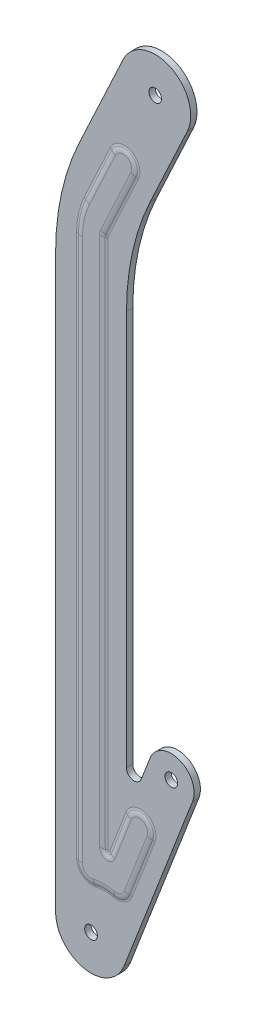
ISO-10303-21;
HEADER;
FILE_DESCRIPTION(('STEP AP214'),'2;1');
FILE_NAME('part.step','',(''),(''),'','','');
FILE_SCHEMA(('AUTOMOTIVE_DESIGN { 1 0 10303 214 1 1 1 1 }'));
ENDSEC;
DATA;
#1=APPLICATION_CONTEXT('core data for automotive mechanical design processes');
#2=APPLICATION_PROTOCOL_DEFINITION('international standard','automotive_design',2000,#1);
#3=PRODUCT_CONTEXT('',#1,'mechanical');
#4=PRODUCT('Part','Part','',(#3));
#5=PRODUCT_RELATED_PRODUCT_CATEGORY('part','',(#4));
#6=PRODUCT_DEFINITION_FORMATION('','',#4);
#7=PRODUCT_DEFINITION_CONTEXT('part definition',#1,'design');
#8=PRODUCT_DEFINITION('design','',#6,#7);
#9=PRODUCT_DEFINITION_SHAPE('','',#8);
#10=(LENGTH_UNIT() NAMED_UNIT(*) SI_UNIT(.MILLI.,.METRE.));
#11=(NAMED_UNIT(*) PLANE_ANGLE_UNIT() SI_UNIT($,.RADIAN.));
#12=(NAMED_UNIT(*) SI_UNIT($,.STERADIAN.) SOLID_ANGLE_UNIT());
#13=UNCERTAINTY_MEASURE_WITH_UNIT(LENGTH_MEASURE(1.E-05),#10,'distance_accuracy_value','');
#14=(GEOMETRIC_REPRESENTATION_CONTEXT(3) GLOBAL_UNCERTAINTY_ASSIGNED_CONTEXT((#13)) GLOBAL_UNIT_ASSIGNED_CONTEXT((#10,
#11,#12)) REPRESENTATION_CONTEXT('',''));
#15=CARTESIAN_POINT('',(0.,0.,0.));
#16=DIRECTION('',(0.,0.,1.));
#17=DIRECTION('',(1.,0.,0.));
#18=AXIS2_PLACEMENT_3D('',#15,#16,#17);
#19=CARTESIAN_POINT('',(86.,225.482233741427,0.));
#20=DIRECTION('',(0.,0.,-1.));
#21=DIRECTION('',(-1.,0.,0.));
#22=AXIS2_PLACEMENT_3D('',#19,#20,#21);
#23=PLANE('',#22);
#24=CARTESIAN_POINT('',(31.6963696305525,67.9730840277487,0.));
#25=DIRECTION('',(0.,0.,1.));
#26=DIRECTION('',(1.,0.,0.));
#27=AXIS2_PLACEMENT_3D('',#24,#25,#26);
#28=CIRCLE('',#27,2.5);
#29=CARTESIAN_POINT('',(34.1963696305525,67.9730840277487,0.));
#30=VERTEX_POINT('',#29);
#31=EDGE_CURVE('E706',#30,#30,#28,.T.);
#32=ORIENTED_EDGE('',*,*,#31,.F.);
#33=EDGE_LOOP('',(#32));
#34=FACE_BOUND('',#33,.T.);
#35=CARTESIAN_POINT('',(0.,0.,0.));
#36=DIRECTION('',(0.,0.,1.));
#37=DIRECTION('',(1.,0.,0.));
#38=AXIS2_PLACEMENT_3D('',#35,#36,#37);
#39=CIRCLE('',#38,2.5);
#40=CARTESIAN_POINT('',(2.5,0.,0.));
#41=VERTEX_POINT('',#40);
#42=EDGE_CURVE('E748',#41,#41,#39,.T.);
#43=ORIENTED_EDGE('',*,*,#42,.F.);
#44=EDGE_LOOP('',(#43));
#45=FACE_BOUND('',#44,.T.);
#46=CARTESIAN_POINT('',(25.357095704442,298.926441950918,0.));
#47=DIRECTION('',(0.,0.,1.));
#48=DIRECTION('',(1.,0.,0.));
#49=AXIS2_PLACEMENT_3D('',#46,#47,#48);
#50=CIRCLE('',#49,2.5);
#51=CARTESIAN_POINT('',(27.857095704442,298.926441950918,0.));
#52=VERTEX_POINT('',#51);
#53=EDGE_CURVE('E754',#52,#52,#50,.T.);
#54=ORIENTED_EDGE('',*,*,#53,.F.);
#55=EDGE_LOOP('',(#54));
#56=FACE_BOUND('',#55,.T.);
#57=CARTESIAN_POINT('',(86.,225.482233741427,0.));
#58=DIRECTION('',(0.,0.,1.));
#59=DIRECTION('',(-1.,0.,0.));
#60=AXIS2_PLACEMENT_3D('',#57,#58,#59);
#61=CIRCLE('',#60,100.);
#62=CARTESIAN_POINT('',(-4.63077870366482,267.744059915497,0.));
#63=VERTEX_POINT('',#62);
#64=CARTESIAN_POINT('',(-14.,225.482233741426,0.));
#65=VERTEX_POINT('',#64);
#66=EDGE_CURVE('E760',#63,#65,#61,.T.);
#67=ORIENTED_EDGE('',*,*,#66,.T.);
#68=DIRECTION('',(0.,-1.,0.));
#69=VECTOR('',#68,1.);
#70=CARTESIAN_POINT('',(-14.,0.,0.));
#71=LINE('',#70,#69);
#72=CARTESIAN_POINT('',(-14.,0.,0.));
#73=VERTEX_POINT('',#72);
#74=EDGE_CURVE('E802',#65,#73,#71,.T.);
#75=ORIENTED_EDGE('',*,*,#74,.T.);
#76=CARTESIAN_POINT('',(0.,0.,0.));
#77=DIRECTION('',(0.,0.,1.));
#78=DIRECTION('',(1.,0.,0.));
#79=AXIS2_PLACEMENT_3D('',#76,#77,#78);
#80=CIRCLE('',#79,14.);
#81=CARTESIAN_POINT('',(13.0545250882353,-5.05760563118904,0.));
#82=VERTEX_POINT('',#81);
#83=EDGE_CURVE('E805',#73,#82,#80,.T.);
#84=ORIENTED_EDGE('',*,*,#83,.T.);
#85=DIRECTION('',(0.361257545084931,0.932466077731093,0.));
#86=VECTOR('',#85,1.);
#87=CARTESIAN_POINT('',(13.0545250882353,-5.05760563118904,0.));
#88=LINE('',#87,#86);
#89=CARTESIAN_POINT('',(40.0885643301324,64.7217661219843,0.));
#90=VERTEX_POINT('',#89);
#91=EDGE_CURVE('E808',#82,#90,#88,.T.);
#92=ORIENTED_EDGE('',*,*,#91,.T.);
#93=CARTESIAN_POINT('',(31.6963696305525,67.9730840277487,0.));
#94=DIRECTION('',(0.,0.,1.));
#95=DIRECTION('',(1.,0.,0.));
#96=AXIS2_PLACEMENT_3D('',#93,#94,#95);
#97=CIRCLE('',#96,9.00000000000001);
#98=CARTESIAN_POINT('',(23.3041749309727,71.2244019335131,0.));
#99=VERTEX_POINT('',#98);
#100=EDGE_CURVE('E811',#90,#99,#97,.T.);
#101=ORIENTED_EDGE('',*,*,#100,.T.);
#102=DIRECTION('',(-0.361257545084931,-0.932466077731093,0.));
#103=VECTOR('',#102,1.);
#104=CARTESIAN_POINT('',(19.7973982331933,62.1728254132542,0.));
#105=LINE('',#104,#103);
#106=CARTESIAN_POINT('',(19.7973982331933,62.1728254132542,0.));
#107=VERTEX_POINT('',#106);
#108=EDGE_CURVE('E814',#99,#107,#105,.T.);
#109=ORIENTED_EDGE('',*,*,#108,.T.);
#110=CARTESIAN_POINT('',(17.,63.256598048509,0.));
#111=DIRECTION('',(0.,0.,-1.));
#112=DIRECTION('',(1.,0.,0.));
#113=AXIS2_PLACEMENT_3D('',#110,#111,#112);
#114=CIRCLE('',#113,3.);
#115=CARTESIAN_POINT('',(14.,63.256598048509,0.));
#116=VERTEX_POINT('',#115);
#117=EDGE_CURVE('E817',#107,#116,#114,.T.);
#118=ORIENTED_EDGE('',*,*,#117,.T.);
#119=DIRECTION('',(0.,1.,0.));
#120=VECTOR('',#119,1.);
#121=CARTESIAN_POINT('',(14.,219.274783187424,0.));
#122=LINE('',#121,#120);
#123=CARTESIAN_POINT('',(14.,219.274783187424,0.));
#124=VERTEX_POINT('',#123);
#125=EDGE_CURVE('E820',#116,#124,#122,.T.);
#126=ORIENTED_EDGE('',*,*,#125,.T.);
#127=CARTESIAN_POINT('',(114.,219.274783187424,0.));
#128=DIRECTION('',(0.,0.,-1.));
#129=DIRECTION('',(1.,0.,0.));
#130=AXIS2_PLACEMENT_3D('',#127,#128,#129);
#131=CIRCLE('',#130,100.);
#132=CARTESIAN_POINT('',(23.3692212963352,261.536609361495,0.));
#133=VERTEX_POINT('',#132);
#134=EDGE_CURVE('E823',#124,#133,#131,.T.);
#135=ORIENTED_EDGE('',*,*,#134,.T.);
#136=DIRECTION('',(0.422618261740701,0.906307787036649,0.));
#137=VECTOR('',#136,1.);
#138=CARTESIAN_POINT('',(38.0454047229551,293.009786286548,0.));
#139=LINE('',#138,#137);
#140=CARTESIAN_POINT('',(38.0454047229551,293.009786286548,0.));
#141=VERTEX_POINT('',#140);
#142=EDGE_CURVE('E826',#133,#141,#139,.T.);
#143=ORIENTED_EDGE('',*,*,#142,.T.);
#144=CARTESIAN_POINT('',(25.357095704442,298.926441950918,0.));
#145=DIRECTION('',(0.,0.,1.));
#146=DIRECTION('',(1.,0.,0.));
#147=AXIS2_PLACEMENT_3D('',#144,#145,#146);
#148=CIRCLE('',#147,14.);
#149=CARTESIAN_POINT('',(12.6687866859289,304.843097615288,0.));
#150=VERTEX_POINT('',#149);
#151=EDGE_CURVE('E829',#141,#150,#148,.T.);
#152=ORIENTED_EDGE('',*,*,#151,.T.);
#153=DIRECTION('',(-0.4226182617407,-0.90630778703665,0.));
#154=VECTOR('',#153,1.);
#155=CARTESIAN_POINT('',(-4.63077870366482,267.744059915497,0.));
#156=LINE('',#155,#154);
#157=EDGE_CURVE('E767',#150,#63,#156,.T.);
#158=ORIENTED_EDGE('',*,*,#157,.T.);
#159=EDGE_LOOP('',(#67,#75,#84,#92,#101,#109,#118,#126,#135,#143,#152,#158));
#160=FACE_BOUND('',#159,.T.);
#161=CARTESIAN_POINT('',(8.48376117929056,240.631825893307,3.06981003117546E-11));
#162=DIRECTION('',(0.,0.,-1.));
#163=DIRECTION('',(-1.,0.,0.));
#164=AXIS2_PLACEMENT_3D('',#161,#162,#163);
#165=CIRCLE('',#164,1.84675441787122);
#166=CARTESIAN_POINT('',(6.81003326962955,241.412298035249,1.53488333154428E-11));
#167=VERTEX_POINT('',#166);
#168=CARTESIAN_POINT('',(6.63700676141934,240.631825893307,0.));
#169=VERTEX_POINT('',#168);
#170=EDGE_CURVE('E61',#167,#169,#165,.F.);
#171=ORIENTED_EDGE('',*,*,#170,.T.);
#172=DIRECTION('',(0.,-1.,0.));
#173=VECTOR('',#172,1.);
#174=CARTESIAN_POINT('',(6.63700676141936,31.3631277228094,3.06985339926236E-11));
#175=LINE('',#174,#173);
#176=CARTESIAN_POINT('',(6.63700676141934,31.3631277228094,0.));
#177=VERTEX_POINT('',#176);
#178=EDGE_CURVE('E66',#169,#177,#175,.T.);
#179=ORIENTED_EDGE('',*,*,#178,.T.);
#180=CARTESIAN_POINT('',(6.98376117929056,31.3631277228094,3.06981003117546E-11));
#181=DIRECTION('',(0.,0.,-1.));
#182=DIRECTION('',(-1.,0.,0.));
#183=AXIS2_PLACEMENT_3D('',#180,#181,#182);
#184=CIRCLE('',#183,0.346754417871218);
#185=CARTESIAN_POINT('',(7.30709232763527,31.23784566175,1.53488333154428E-11));
#186=VERTEX_POINT('',#185);
#187=EDGE_CURVE('E449',#177,#186,#184,.F.);
#188=ORIENTED_EDGE('',*,*,#187,.T.);
#189=DIRECTION('',(0.361299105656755,0.932449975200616,0.));
#190=VECTOR('',#189,1.);
#191=CARTESIAN_POINT('',(7.30709232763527,31.23784566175,3.06972329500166E-11));
#192=LINE('',#191,#190);
#193=CARTESIAN_POINT('',(13.7786451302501,47.9397947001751,1.53483172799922E-11));
#194=VERTEX_POINT('',#193);
#195=EDGE_CURVE('E436',#186,#194,#192,.T.);
#196=ORIENTED_EDGE('',*,*,#195,.T.);
#197=CARTESIAN_POINT('',(19.5162388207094,45.7166325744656,3.06963655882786E-11));
#198=DIRECTION('',(0.,0.,1.));
#199=DIRECTION('',(1.,0.,0.));
#200=AXIS2_PLACEMENT_3D('',#197,#198,#199);
#201=CIRCLE('',#200,6.15324558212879);
#202=CARTESIAN_POINT('',(25.2538325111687,43.4934704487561,1.53475322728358E-11));
#203=VERTEX_POINT('',#202);
#204=EDGE_CURVE('E426',#194,#203,#201,.F.);
#205=ORIENTED_EDGE('',*,*,#204,.T.);
#206=DIRECTION('',(-0.361299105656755,-0.932449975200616,0.));
#207=VECTOR('',#206,1.);
#208=CARTESIAN_POINT('',(16.2213548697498,20.1822210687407,3.06976666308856E-11));
#209=LINE('',#208,#207);
#210=CARTESIAN_POINT('',(16.2213548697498,20.1822210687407,1.53484819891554E-11));
#211=VERTEX_POINT('',#210);
#212=EDGE_CURVE('E420',#203,#211,#209,.T.);
#213=ORIENTED_EDGE('',*,*,#212,.T.);
#214=CARTESIAN_POINT('',(10.4837611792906,22.4053831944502,3.06972329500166E-11));
#215=DIRECTION('',(0.,0.,1.));
#216=DIRECTION('',(1.,0.,0.));
#217=AXIS2_PLACEMENT_3D('',#214,#215,#216);
#218=CIRCLE('',#217,6.1532455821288);
#219=CARTESIAN_POINT('',(8.9913799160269,16.4358581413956,1.53481848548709E-11));
#220=VERTEX_POINT('',#219);
#221=EDGE_CURVE('E506',#211,#220,#218,.F.);
#222=ORIENTED_EDGE('',*,*,#221,.T.);
#223=CARTESIAN_POINT('',(5.48376117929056,2.40538319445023,3.06981003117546E-11));
#224=DIRECTION('',(0.,0.,-1.));
#225=DIRECTION('',(-1.,0.,0.));
#226=AXIS2_PLACEMENT_3D('',#223,#224,#225);
#227=CIRCLE('',#226,14.4622825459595);
#228=CARTESIAN_POINT('',(1.97614244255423,16.4358581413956,3.06985298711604E-11));
#229=VERTEX_POINT('',#228);
#230=EDGE_CURVE('E516',#220,#229,#227,.F.);
#231=ORIENTED_EDGE('',*,*,#230,.T.);
#232=CARTESIAN_POINT('',(0.483761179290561,22.4053831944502,3.06989676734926E-11));
#233=DIRECTION('',(0.,0.,1.));
#234=DIRECTION('',(1.,0.,0.));
#235=AXIS2_PLACEMENT_3D('',#232,#233,#234);
#236=CIRCLE('',#235,6.15324558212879);
#237=CARTESIAN_POINT('',(-5.66948440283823,22.4053831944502,1.53498606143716E-11));
#238=VERTEX_POINT('',#237);
#239=EDGE_CURVE('E557',#229,#238,#236,.F.);
#240=ORIENTED_EDGE('',*,*,#239,.T.);
#241=DIRECTION('',(0.,1.,0.));
#242=VECTOR('',#241,1.);
#243=CARTESIAN_POINT('',(-5.66948440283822,22.4053831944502,3.06994013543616E-11));
#244=LINE('',#243,#242);
#245=CARTESIAN_POINT('',(-5.66948440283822,236.641321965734,1.53497006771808E-11));
#246=VERTEX_POINT('',#245);
#247=EDGE_CURVE('E554',#238,#246,#244,.T.);
#248=ORIENTED_EDGE('',*,*,#247,.T.);
#249=CARTESIAN_POINT('',(26.4837611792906,236.641321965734,3.06954982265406E-11));
#250=DIRECTION('',(0.,0.,1.));
#251=DIRECTION('',(1.,0.,0.));
#252=AXIS2_PLACEMENT_3D('',#249,#250,#251);
#253=CIRCLE('',#252,32.1532455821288);
#254=CARTESIAN_POINT('',(-2.65697567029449,250.229870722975,1.53510513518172E-11));
#255=VERTEX_POINT('',#254);
#256=EDGE_CURVE('E537',#246,#255,#253,.F.);
#257=ORIENTED_EDGE('',*,*,#256,.T.);
#258=DIRECTION('',(0.422618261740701,0.906307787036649,0.));
#259=VECTOR('',#258,1.);
#260=CARTESIAN_POINT('',(-2.6569756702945,250.229870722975,3.06989676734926E-11));
#261=LINE('',#260,#259);
#262=CARTESIAN_POINT('',(7.5855746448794,272.195090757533,1.53483996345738E-11));
#263=VERTEX_POINT('',#262);
#264=EDGE_CURVE('E539',#255,#263,#261,.T.);
#265=ORIENTED_EDGE('',*,*,#264,.T.);
#266=CARTESIAN_POINT('',(13.1623090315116,269.59461680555,3.06972329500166E-11));
#267=DIRECTION('',(0.,0.,1.));
#268=DIRECTION('',(1.,0.,0.));
#269=AXIS2_PLACEMENT_3D('',#266,#267,#268);
#270=CIRCLE('',#269,6.1532455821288);
#271=CARTESIAN_POINT('',(18.7390434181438,266.994142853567,1.5348058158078E-11));
#272=VERTEX_POINT('',#271);
#273=EDGE_CURVE('E541',#263,#272,#270,.F.);
#274=ORIENTED_EDGE('',*,*,#273,.T.);
#275=DIRECTION('',(-0.422618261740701,-0.906307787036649,0.));
#276=VECTOR('',#275,1.);
#277=CARTESIAN_POINT('',(6.81003326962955,241.412298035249,3.06981003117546E-11));
#278=LINE('',#277,#276);
#279=EDGE_CURVE('E543',#272,#167,#278,.T.);
#280=ORIENTED_EDGE('',*,*,#279,.T.);
#281=EDGE_LOOP('',(#171,#179,#188,#196,#205,#213,#222,#231,#240,#248,#257,#265,#274,#280));
#282=FACE_BOUND('',#281,.T.);
#283=ADVANCED_FACE('F44',(#34,#45,#56,#160,#282),#23,.F.);
#284=CARTESIAN_POINT('',(86.,225.482233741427,-2.5));
#285=DIRECTION('',(0.,0.,-1.));
#286=DIRECTION('',(-1.,0.,0.));
#287=AXIS2_PLACEMENT_3D('',#284,#285,#286);
#288=PLANE('',#287);
#289=CARTESIAN_POINT('',(31.6963696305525,67.9730840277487,-2.5));
#290=DIRECTION('',(0.,0.,1.));
#291=DIRECTION('',(1.,0.,0.));
#292=AXIS2_PLACEMENT_3D('',#289,#290,#291);
#293=CIRCLE('',#292,2.5);
#294=CARTESIAN_POINT('',(34.1963696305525,67.9730840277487,-2.5));
#295=VERTEX_POINT('',#294);
#296=EDGE_CURVE('E745',#295,#295,#293,.T.);
#297=ORIENTED_EDGE('',*,*,#296,.T.);
#298=EDGE_LOOP('',(#297));
#299=FACE_BOUND('',#298,.T.);
#300=CARTESIAN_POINT('',(0.,0.,-2.5));
#301=DIRECTION('',(0.,0.,1.));
#302=DIRECTION('',(1.,0.,0.));
#303=AXIS2_PLACEMENT_3D('',#300,#301,#302);
#304=CIRCLE('',#303,2.5);
#305=CARTESIAN_POINT('',(2.5,0.,-2.5));
#306=VERTEX_POINT('',#305);
#307=EDGE_CURVE('E751',#306,#306,#304,.T.);
#308=ORIENTED_EDGE('',*,*,#307,.T.);
#309=EDGE_LOOP('',(#308));
#310=FACE_BOUND('',#309,.T.);
#311=CARTESIAN_POINT('',(25.357095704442,298.926441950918,-2.5));
#312=DIRECTION('',(0.,0.,1.));
#313=DIRECTION('',(1.,0.,0.));
#314=AXIS2_PLACEMENT_3D('',#311,#312,#313);
#315=CIRCLE('',#314,2.5);
#316=CARTESIAN_POINT('',(27.857095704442,298.926441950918,-2.5));
#317=VERTEX_POINT('',#316);
#318=EDGE_CURVE('E757',#317,#317,#315,.T.);
#319=ORIENTED_EDGE('',*,*,#318,.T.);
#320=EDGE_LOOP('',(#319));
#321=FACE_BOUND('',#320,.T.);
#322=CARTESIAN_POINT('',(86.,225.482233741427,-2.5));
#323=DIRECTION('',(0.,0.,1.));
#324=DIRECTION('',(-1.,0.,0.));
#325=AXIS2_PLACEMENT_3D('',#322,#323,#324);
#326=CIRCLE('',#325,100.);
#327=CARTESIAN_POINT('',(-4.63077870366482,267.744059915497,-2.5));
#328=VERTEX_POINT('',#327);
#329=CARTESIAN_POINT('',(-14.,225.482233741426,-2.5));
#330=VERTEX_POINT('',#329);
#331=EDGE_CURVE('E763',#328,#330,#326,.T.);
#332=ORIENTED_EDGE('',*,*,#331,.F.);
#333=DIRECTION('',(-0.4226182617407,-0.90630778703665,0.));
#334=VECTOR('',#333,1.);
#335=CARTESIAN_POINT('',(-4.63077870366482,267.744059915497,-2.5));
#336=LINE('',#335,#334);
#337=CARTESIAN_POINT('',(12.6687866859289,304.843097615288,-2.5));
#338=VERTEX_POINT('',#337);
#339=EDGE_CURVE('E797',#338,#328,#336,.T.);
#340=ORIENTED_EDGE('',*,*,#339,.F.);
#341=CARTESIAN_POINT('',(25.357095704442,298.926441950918,-2.5));
#342=DIRECTION('',(0.,0.,1.));
#343=DIRECTION('',(1.,0.,0.));
#344=AXIS2_PLACEMENT_3D('',#341,#342,#343);
#345=CIRCLE('',#344,14.);
#346=CARTESIAN_POINT('',(38.0454047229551,293.009786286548,-2.5));
#347=VERTEX_POINT('',#346);
#348=EDGE_CURVE('E794',#347,#338,#345,.T.);
#349=ORIENTED_EDGE('',*,*,#348,.F.);
#350=DIRECTION('',(0.422618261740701,0.906307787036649,0.));
#351=VECTOR('',#350,1.);
#352=CARTESIAN_POINT('',(38.0454047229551,293.009786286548,-2.5));
#353=LINE('',#352,#351);
#354=CARTESIAN_POINT('',(23.3692212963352,261.536609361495,-2.5));
#355=VERTEX_POINT('',#354);
#356=EDGE_CURVE('E791',#355,#347,#353,.T.);
#357=ORIENTED_EDGE('',*,*,#356,.F.);
#358=CARTESIAN_POINT('',(114.,219.274783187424,-2.5));
#359=DIRECTION('',(0.,0.,-1.));
#360=DIRECTION('',(1.,0.,0.));
#361=AXIS2_PLACEMENT_3D('',#358,#359,#360);
#362=CIRCLE('',#361,100.);
#363=CARTESIAN_POINT('',(14.,219.274783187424,-2.5));
#364=VERTEX_POINT('',#363);
#365=EDGE_CURVE('E788',#364,#355,#362,.T.);
#366=ORIENTED_EDGE('',*,*,#365,.F.);
#367=DIRECTION('',(0.,1.,0.));
#368=VECTOR('',#367,1.);
#369=CARTESIAN_POINT('',(14.,219.274783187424,-2.5));
#370=LINE('',#369,#368);
#371=CARTESIAN_POINT('',(14.,63.256598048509,-2.5));
#372=VERTEX_POINT('',#371);
#373=EDGE_CURVE('E785',#372,#364,#370,.T.);
#374=ORIENTED_EDGE('',*,*,#373,.F.);
#375=CARTESIAN_POINT('',(17.,63.256598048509,-2.5));
#376=DIRECTION('',(0.,0.,-1.));
#377=DIRECTION('',(1.,0.,0.));
#378=AXIS2_PLACEMENT_3D('',#375,#376,#377);
#379=CIRCLE('',#378,3.);
#380=CARTESIAN_POINT('',(19.7973982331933,62.1728254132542,-2.5));
#381=VERTEX_POINT('',#380);
#382=EDGE_CURVE('E782',#381,#372,#379,.T.);
#383=ORIENTED_EDGE('',*,*,#382,.F.);
#384=DIRECTION('',(-0.361257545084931,-0.932466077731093,0.));
#385=VECTOR('',#384,1.);
#386=CARTESIAN_POINT('',(19.7973982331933,62.1728254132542,-2.5));
#387=LINE('',#386,#385);
#388=CARTESIAN_POINT('',(23.3041749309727,71.2244019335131,-2.5));
#389=VERTEX_POINT('',#388);
#390=EDGE_CURVE('E779',#389,#381,#387,.T.);
#391=ORIENTED_EDGE('',*,*,#390,.F.);
#392=CARTESIAN_POINT('',(31.6963696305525,67.9730840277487,-2.5));
#393=DIRECTION('',(0.,0.,1.));
#394=DIRECTION('',(1.,0.,0.));
#395=AXIS2_PLACEMENT_3D('',#392,#393,#394);
#396=CIRCLE('',#395,9.00000000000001);
#397=CARTESIAN_POINT('',(40.0885643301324,64.7217661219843,-2.5));
#398=VERTEX_POINT('',#397);
#399=EDGE_CURVE('E776',#398,#389,#396,.T.);
#400=ORIENTED_EDGE('',*,*,#399,.F.);
#401=DIRECTION('',(0.361257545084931,0.932466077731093,0.));
#402=VECTOR('',#401,1.);
#403=CARTESIAN_POINT('',(13.0545250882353,-5.05760563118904,-2.5));
#404=LINE('',#403,#402);
#405=CARTESIAN_POINT('',(13.0545250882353,-5.05760563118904,-2.5));
#406=VERTEX_POINT('',#405);
#407=EDGE_CURVE('E773',#406,#398,#404,.T.);
#408=ORIENTED_EDGE('',*,*,#407,.F.);
#409=CARTESIAN_POINT('',(0.,0.,-2.5));
#410=DIRECTION('',(0.,0.,1.));
#411=DIRECTION('',(1.,0.,0.));
#412=AXIS2_PLACEMENT_3D('',#409,#410,#411);
#413=CIRCLE('',#412,14.);
#414=CARTESIAN_POINT('',(-14.,0.,-2.5));
#415=VERTEX_POINT('',#414);
#416=EDGE_CURVE('E770',#415,#406,#413,.T.);
#417=ORIENTED_EDGE('',*,*,#416,.F.);
#418=DIRECTION('',(0.,-1.,0.));
#419=VECTOR('',#418,1.);
#420=CARTESIAN_POINT('',(-14.,0.,-2.5));
#421=LINE('',#420,#419);
#422=EDGE_CURVE('E766',#330,#415,#421,.T.);
#423=ORIENTED_EDGE('',*,*,#422,.F.);
#424=EDGE_LOOP('',(#332,#340,#349,#357,#366,#374,#383,#391,#400,#408,#417,#423));
#425=FACE_BOUND('',#424,.T.);
#426=DIRECTION('',(0.,-1.,0.));
#427=VECTOR('',#426,1.);
#428=CARTESIAN_POINT('',(-5.66948440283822,236.641321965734,-2.4999999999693));
#429=LINE('',#428,#427);
#430=CARTESIAN_POINT('',(-5.66948440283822,22.4053831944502,-2.4999999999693));
#431=VERTEX_POINT('',#430);
#432=CARTESIAN_POINT('',(-5.66948440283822,236.641321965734,-2.4999999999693));
#433=VERTEX_POINT('',#432);
#434=EDGE_CURVE('E585',#431,#433,#429,.F.);
#435=ORIENTED_EDGE('',*,*,#434,.F.);
#436=CARTESIAN_POINT('',(0.483761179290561,22.4053831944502,-2.4999999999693));
#437=DIRECTION('',(0.,0.,1.));
#438=DIRECTION('',(1.,0.,0.));
#439=AXIS2_PLACEMENT_3D('',#436,#437,#438);
#440=CIRCLE('',#439,6.15324558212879);
#441=CARTESIAN_POINT('',(1.97614244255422,16.4358581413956,-2.4999999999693));
#442=VERTEX_POINT('',#441);
#443=EDGE_CURVE('E587',#442,#431,#440,.F.);
#444=ORIENTED_EDGE('',*,*,#443,.F.);
#445=CARTESIAN_POINT('',(5.48376117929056,2.40538319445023,-2.4999999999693));
#446=DIRECTION('',(0.,0.,1.));
#447=DIRECTION('',(1.,0.,0.));
#448=AXIS2_PLACEMENT_3D('',#445,#446,#447);
#449=CIRCLE('',#448,14.4622825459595);
#450=CARTESIAN_POINT('',(8.9913799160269,16.4358581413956,-2.4999999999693));
#451=VERTEX_POINT('',#450);
#452=EDGE_CURVE('E589',#451,#442,#449,.T.);
#453=ORIENTED_EDGE('',*,*,#452,.F.);
#454=CARTESIAN_POINT('',(10.4837611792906,22.4053831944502,-2.4999999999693));
#455=DIRECTION('',(0.,0.,1.));
#456=DIRECTION('',(1.,0.,0.));
#457=AXIS2_PLACEMENT_3D('',#454,#455,#456);
#458=CIRCLE('',#457,6.1532455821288);
#459=CARTESIAN_POINT('',(16.2213548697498,20.1822210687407,-2.4999999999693));
#460=VERTEX_POINT('',#459);
#461=EDGE_CURVE('E591',#460,#451,#458,.F.);
#462=ORIENTED_EDGE('',*,*,#461,.F.);
#463=DIRECTION('',(0.361299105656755,0.932449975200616,0.));
#464=VECTOR('',#463,1.);
#465=CARTESIAN_POINT('',(16.2213548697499,20.1822210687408,-2.4999999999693));
#466=LINE('',#465,#464);
#467=CARTESIAN_POINT('',(25.2538325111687,43.4934704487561,-2.4999999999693));
#468=VERTEX_POINT('',#467);
#469=EDGE_CURVE('E593',#468,#460,#466,.F.);
#470=ORIENTED_EDGE('',*,*,#469,.F.);
#471=CARTESIAN_POINT('',(19.5162388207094,45.7166325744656,-2.4999999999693));
#472=DIRECTION('',(0.,0.,1.));
#473=DIRECTION('',(1.,0.,0.));
#474=AXIS2_PLACEMENT_3D('',#471,#472,#473);
#475=CIRCLE('',#474,6.15324558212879);
#476=CARTESIAN_POINT('',(13.7786451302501,47.9397947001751,-2.4999999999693));
#477=VERTEX_POINT('',#476);
#478=EDGE_CURVE('E595',#477,#468,#475,.F.);
#479=ORIENTED_EDGE('',*,*,#478,.F.);
#480=DIRECTION('',(-0.361299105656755,-0.932449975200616,0.));
#481=VECTOR('',#480,1.);
#482=CARTESIAN_POINT('',(13.7786451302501,47.9397947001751,-2.4999999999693));
#483=LINE('',#482,#481);
#484=CARTESIAN_POINT('',(7.30709232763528,31.23784566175,-2.4999999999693));
#485=VERTEX_POINT('',#484);
#486=EDGE_CURVE('E597',#485,#477,#483,.F.);
#487=ORIENTED_EDGE('',*,*,#486,.F.);
#488=CARTESIAN_POINT('',(6.98376117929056,31.3631277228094,-2.4999999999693));
#489=DIRECTION('',(0.,0.,1.));
#490=DIRECTION('',(1.,0.,0.));
#491=AXIS2_PLACEMENT_3D('',#488,#489,#490);
#492=CIRCLE('',#491,0.346754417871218);
#493=CARTESIAN_POINT('',(6.63700676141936,31.3631277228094,-2.4999999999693));
#494=VERTEX_POINT('',#493);
#495=EDGE_CURVE('E599',#494,#485,#492,.T.);
#496=ORIENTED_EDGE('',*,*,#495,.F.);
#497=DIRECTION('',(0.,1.,0.));
#498=VECTOR('',#497,1.);
#499=CARTESIAN_POINT('',(6.63700676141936,31.3631277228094,-2.4999999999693));
#500=LINE('',#499,#498);
#501=CARTESIAN_POINT('',(6.63700676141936,240.631825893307,-2.49999999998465));
#502=VERTEX_POINT('',#501);
#503=EDGE_CURVE('E601',#502,#494,#500,.F.);
#504=ORIENTED_EDGE('',*,*,#503,.F.);
#505=CARTESIAN_POINT('',(8.48376117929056,240.631825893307,-2.4999999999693));
#506=DIRECTION('',(0.,0.,1.));
#507=DIRECTION('',(1.,0.,0.));
#508=AXIS2_PLACEMENT_3D('',#505,#506,#507);
#509=CIRCLE('',#508,1.84675441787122);
#510=CARTESIAN_POINT('',(6.81003326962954,241.412298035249,-2.4999999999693));
#511=VERTEX_POINT('',#510);
#512=EDGE_CURVE('E603',#511,#502,#509,.T.);
#513=ORIENTED_EDGE('',*,*,#512,.F.);
#514=DIRECTION('',(0.422618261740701,0.906307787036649,0.));
#515=VECTOR('',#514,1.);
#516=CARTESIAN_POINT('',(6.81003326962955,241.412298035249,-2.4999999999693));
#517=LINE('',#516,#515);
#518=CARTESIAN_POINT('',(18.7390434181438,266.994142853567,-2.4999999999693));
#519=VERTEX_POINT('',#518);
#520=EDGE_CURVE('E576',#519,#511,#517,.F.);
#521=ORIENTED_EDGE('',*,*,#520,.F.);
#522=CARTESIAN_POINT('',(13.1623090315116,269.59461680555,-2.4999999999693));
#523=DIRECTION('',(0.,0.,1.));
#524=DIRECTION('',(1.,0.,0.));
#525=AXIS2_PLACEMENT_3D('',#522,#523,#524);
#526=CIRCLE('',#525,6.1532455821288);
#527=CARTESIAN_POINT('',(7.5855746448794,272.195090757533,-2.4999999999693));
#528=VERTEX_POINT('',#527);
#529=EDGE_CURVE('E578',#528,#519,#526,.F.);
#530=ORIENTED_EDGE('',*,*,#529,.F.);
#531=DIRECTION('',(-0.422618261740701,-0.906307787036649,0.));
#532=VECTOR('',#531,1.);
#533=CARTESIAN_POINT('',(7.58557464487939,272.195090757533,-2.4999999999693));
#534=LINE('',#533,#532);
#535=CARTESIAN_POINT('',(-2.6569756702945,250.229870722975,-2.4999999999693));
#536=VERTEX_POINT('',#535);
#537=EDGE_CURVE('E581',#536,#528,#534,.F.);
#538=ORIENTED_EDGE('',*,*,#537,.F.);
#539=CARTESIAN_POINT('',(26.4837611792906,236.641321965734,-2.4999999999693));
#540=DIRECTION('',(0.,0.,1.));
#541=DIRECTION('',(1.,0.,0.));
#542=AXIS2_PLACEMENT_3D('',#539,#540,#541);
#543=CIRCLE('',#542,32.1532455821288);
#544=EDGE_CURVE('E583',#433,#536,#543,.F.);
#545=ORIENTED_EDGE('',*,*,#544,.F.);
#546=EDGE_LOOP('',(#435,#444,#453,#462,#470,#479,#487,#496,#504,#513,#521,#530,#538,#545));
#547=FACE_BOUND('',#546,.T.);
#548=ADVANCED_FACE('F866',(#299,#310,#321,#425,#547),#288,.T.);
#549=CARTESIAN_POINT('',(86.,225.482233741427,-2.5));
#550=DIRECTION('',(0.,0.,1.));
#551=DIRECTION('',(1.,0.,0.));
#552=AXIS2_PLACEMENT_3D('',#549,#550,#551);
#553=CYLINDRICAL_SURFACE('',#552,100.);
#554=ORIENTED_EDGE('',*,*,#66,.F.);
#555=DIRECTION('',(0.,0.,1.));
#556=VECTOR('',#555,1.);
#557=CARTESIAN_POINT('',(-4.63077870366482,267.744059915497,-2.5));
#558=LINE('',#557,#556);
#559=EDGE_CURVE('E11',#328,#63,#558,.T.);
#560=ORIENTED_EDGE('',*,*,#559,.F.);
#561=ORIENTED_EDGE('',*,*,#331,.T.);
#562=DIRECTION('',(0.,0.,1.));
#563=VECTOR('',#562,1.);
#564=CARTESIAN_POINT('',(-14.,225.482233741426,-2.5));
#565=LINE('',#564,#563);
#566=EDGE_CURVE('E48',#330,#65,#565,.T.);
#567=ORIENTED_EDGE('',*,*,#566,.T.);
#568=EDGE_LOOP('',(#554,#560,#561,#567));
#569=FACE_BOUND('',#568,.T.);
#570=ADVANCED_FACE('F46',(#569),#553,.T.);
#571=CARTESIAN_POINT('',(-4.63077870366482,267.744059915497,-2.5));
#572=DIRECTION('',(-0.90630778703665,0.4226182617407,0.));
#573=DIRECTION('',(-0.4226182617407,-0.90630778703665,0.));
#574=AXIS2_PLACEMENT_3D('',#571,#572,#573);
#575=PLANE('',#574);
#576=ORIENTED_EDGE('',*,*,#157,.F.);
#577=DIRECTION('',(0.,0.,1.));
#578=VECTOR('',#577,1.);
#579=CARTESIAN_POINT('',(12.6687866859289,304.843097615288,-2.5));
#580=LINE('',#579,#578);
#581=EDGE_CURVE('E53',#338,#150,#580,.T.);
#582=ORIENTED_EDGE('',*,*,#581,.F.);
#583=ORIENTED_EDGE('',*,*,#339,.T.);
#584=ORIENTED_EDGE('',*,*,#559,.T.);
#585=EDGE_LOOP('',(#576,#582,#583,#584));
#586=FACE_BOUND('',#585,.T.);
#587=ADVANCED_FACE('F863',(#586),#575,.T.);
#588=CARTESIAN_POINT('',(25.357095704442,298.926441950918,-2.5));
#589=DIRECTION('',(0.,0.,1.));
#590=DIRECTION('',(1.,0.,0.));
#591=AXIS2_PLACEMENT_3D('',#588,#589,#590);
#592=CYLINDRICAL_SURFACE('',#591,14.);
#593=ORIENTED_EDGE('',*,*,#151,.F.);
#594=DIRECTION('',(0.,0.,1.));
#595=VECTOR('',#594,1.);
#596=CARTESIAN_POINT('',(38.0454047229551,293.009786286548,-2.5));
#597=LINE('',#596,#595);
#598=EDGE_CURVE('E835',#347,#141,#597,.T.);
#599=ORIENTED_EDGE('',*,*,#598,.F.);
#600=ORIENTED_EDGE('',*,*,#348,.T.);
#601=ORIENTED_EDGE('',*,*,#581,.T.);
#602=EDGE_LOOP('',(#593,#599,#600,#601));
#603=FACE_BOUND('',#602,.T.);
#604=ADVANCED_FACE('F901',(#603),#592,.T.);
#605=CARTESIAN_POINT('',(38.0454047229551,293.009786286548,-2.5));
#606=DIRECTION('',(0.906307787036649,-0.422618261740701,0.));
#607=DIRECTION('',(0.422618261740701,0.906307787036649,0.));
#608=AXIS2_PLACEMENT_3D('',#605,#606,#607);
#609=PLANE('',#608);
#610=ORIENTED_EDGE('',*,*,#142,.F.);
#611=DIRECTION('',(0.,0.,1.));
#612=VECTOR('',#611,1.);
#613=CARTESIAN_POINT('',(23.3692212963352,261.536609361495,-2.5));
#614=LINE('',#613,#612);
#615=EDGE_CURVE('E837',#355,#133,#614,.T.);
#616=ORIENTED_EDGE('',*,*,#615,.F.);
#617=ORIENTED_EDGE('',*,*,#356,.T.);
#618=ORIENTED_EDGE('',*,*,#598,.T.);
#619=EDGE_LOOP('',(#610,#616,#617,#618));
#620=FACE_BOUND('',#619,.T.);
#621=ADVANCED_FACE('F898',(#620),#609,.T.);
#622=CARTESIAN_POINT('',(114.,219.274783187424,-2.5));
#623=DIRECTION('',(0.,0.,1.));
#624=DIRECTION('',(1.,0.,0.));
#625=AXIS2_PLACEMENT_3D('',#622,#623,#624);
#626=CYLINDRICAL_SURFACE('',#625,100.);
#627=ORIENTED_EDGE('',*,*,#134,.F.);
#628=DIRECTION('',(0.,0.,1.));
#629=VECTOR('',#628,1.);
#630=CARTESIAN_POINT('',(14.,219.274783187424,-2.5));
#631=LINE('',#630,#629);
#632=EDGE_CURVE('E839',#364,#124,#631,.T.);
#633=ORIENTED_EDGE('',*,*,#632,.F.);
#634=ORIENTED_EDGE('',*,*,#365,.T.);
#635=ORIENTED_EDGE('',*,*,#615,.T.);
#636=EDGE_LOOP('',(#627,#633,#634,#635));
#637=FACE_BOUND('',#636,.T.);
#638=ADVANCED_FACE('F895',(#637),#626,.F.);
#639=CARTESIAN_POINT('',(14.,219.274783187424,-2.5));
#640=DIRECTION('',(1.,0.,0.));
#641=DIRECTION('',(0.,1.,0.));
#642=AXIS2_PLACEMENT_3D('',#639,#640,#641);
#643=PLANE('',#642);
#644=ORIENTED_EDGE('',*,*,#125,.F.);
#645=DIRECTION('',(0.,0.,1.));
#646=VECTOR('',#645,1.);
#647=CARTESIAN_POINT('',(14.,63.256598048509,-2.5));
#648=LINE('',#647,#646);
#649=EDGE_CURVE('E841',#372,#116,#648,.T.);
#650=ORIENTED_EDGE('',*,*,#649,.F.);
#651=ORIENTED_EDGE('',*,*,#373,.T.);
#652=ORIENTED_EDGE('',*,*,#632,.T.);
#653=EDGE_LOOP('',(#644,#650,#651,#652));
#654=FACE_BOUND('',#653,.T.);
#655=ADVANCED_FACE('F891',(#654),#643,.T.);
#656=CARTESIAN_POINT('',(17.,63.256598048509,-2.5));
#657=DIRECTION('',(0.,0.,1.));
#658=DIRECTION('',(1.,0.,0.));
#659=AXIS2_PLACEMENT_3D('',#656,#657,#658);
#660=CYLINDRICAL_SURFACE('',#659,3.);
#661=ORIENTED_EDGE('',*,*,#117,.F.);
#662=DIRECTION('',(0.,0.,1.));
#663=VECTOR('',#662,1.);
#664=CARTESIAN_POINT('',(19.7973982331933,62.1728254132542,-2.5));
#665=LINE('',#664,#663);
#666=EDGE_CURVE('E843',#381,#107,#665,.T.);
#667=ORIENTED_EDGE('',*,*,#666,.F.);
#668=ORIENTED_EDGE('',*,*,#382,.T.);
#669=ORIENTED_EDGE('',*,*,#649,.T.);
#670=EDGE_LOOP('',(#661,#667,#668,#669));
#671=FACE_BOUND('',#670,.T.);
#672=ADVANCED_FACE('F887',(#671),#660,.F.);
#673=CARTESIAN_POINT('',(19.7973982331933,62.1728254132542,-2.5));
#674=DIRECTION('',(-0.932466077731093,0.361257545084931,0.));
#675=DIRECTION('',(-0.361257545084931,-0.932466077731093,0.));
#676=AXIS2_PLACEMENT_3D('',#673,#674,#675);
#677=PLANE('',#676);
#678=ORIENTED_EDGE('',*,*,#108,.F.);
#679=DIRECTION('',(0.,0.,1.));
#680=VECTOR('',#679,1.);
#681=CARTESIAN_POINT('',(23.3041749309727,71.2244019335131,-2.5));
#682=LINE('',#681,#680);
#683=EDGE_CURVE('E845',#389,#99,#682,.T.);
#684=ORIENTED_EDGE('',*,*,#683,.F.);
#685=ORIENTED_EDGE('',*,*,#390,.T.);
#686=ORIENTED_EDGE('',*,*,#666,.T.);
#687=EDGE_LOOP('',(#678,#684,#685,#686));
#688=FACE_BOUND('',#687,.T.);
#689=ADVANCED_FACE('F883',(#688),#677,.T.);
#690=CARTESIAN_POINT('',(31.6963696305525,67.9730840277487,-2.5));
#691=DIRECTION('',(0.,0.,1.));
#692=DIRECTION('',(1.,0.,0.));
#693=AXIS2_PLACEMENT_3D('',#690,#691,#692);
#694=CYLINDRICAL_SURFACE('',#693,9.00000000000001);
#695=ORIENTED_EDGE('',*,*,#100,.F.);
#696=DIRECTION('',(0.,0.,1.));
#697=VECTOR('',#696,1.);
#698=CARTESIAN_POINT('',(40.0885643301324,64.7217661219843,-2.5));
#699=LINE('',#698,#697);
#700=EDGE_CURVE('E847',#398,#90,#699,.T.);
#701=ORIENTED_EDGE('',*,*,#700,.F.);
#702=ORIENTED_EDGE('',*,*,#399,.T.);
#703=ORIENTED_EDGE('',*,*,#683,.T.);
#704=EDGE_LOOP('',(#695,#701,#702,#703));
#705=FACE_BOUND('',#704,.T.);
#706=ADVANCED_FACE('F879',(#705),#694,.T.);
#707=CARTESIAN_POINT('',(13.0545250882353,-5.05760563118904,-2.5));
#708=DIRECTION('',(0.932466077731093,-0.361257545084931,0.));
#709=DIRECTION('',(0.361257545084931,0.932466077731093,0.));
#710=AXIS2_PLACEMENT_3D('',#707,#708,#709);
#711=PLANE('',#710);
#712=ORIENTED_EDGE('',*,*,#91,.F.);
#713=DIRECTION('',(0.,0.,1.));
#714=VECTOR('',#713,1.);
#715=CARTESIAN_POINT('',(13.0545250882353,-5.05760563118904,-2.5));
#716=LINE('',#715,#714);
#717=EDGE_CURVE('E849',#406,#82,#716,.T.);
#718=ORIENTED_EDGE('',*,*,#717,.F.);
#719=ORIENTED_EDGE('',*,*,#407,.T.);
#720=ORIENTED_EDGE('',*,*,#700,.T.);
#721=EDGE_LOOP('',(#712,#718,#719,#720));
#722=FACE_BOUND('',#721,.T.);
#723=ADVANCED_FACE('F877',(#722),#711,.T.);
#724=CARTESIAN_POINT('',(0.,0.,-2.5));
#725=DIRECTION('',(0.,0.,1.));
#726=DIRECTION('',(1.,0.,0.));
#727=AXIS2_PLACEMENT_3D('',#724,#725,#726);
#728=CYLINDRICAL_SURFACE('',#727,14.);
#729=ORIENTED_EDGE('',*,*,#83,.F.);
#730=DIRECTION('',(0.,0.,1.));
#731=VECTOR('',#730,1.);
#732=CARTESIAN_POINT('',(-14.,0.,-2.5));
#733=LINE('',#732,#731);
#734=EDGE_CURVE('E850',#415,#73,#733,.T.);
#735=ORIENTED_EDGE('',*,*,#734,.F.);
#736=ORIENTED_EDGE('',*,*,#416,.T.);
#737=ORIENTED_EDGE('',*,*,#717,.T.);
#738=EDGE_LOOP('',(#729,#735,#736,#737));
#739=FACE_BOUND('',#738,.T.);
#740=ADVANCED_FACE('F873',(#739),#728,.T.);
#741=CARTESIAN_POINT('',(-14.,0.,-2.5));
#742=DIRECTION('',(-1.,0.,0.));
#743=DIRECTION('',(0.,-1.,0.));
#744=AXIS2_PLACEMENT_3D('',#741,#742,#743);
#745=PLANE('',#744);
#746=ORIENTED_EDGE('',*,*,#74,.F.);
#747=ORIENTED_EDGE('',*,*,#566,.F.);
#748=ORIENTED_EDGE('',*,*,#422,.T.);
#749=ORIENTED_EDGE('',*,*,#734,.T.);
#750=EDGE_LOOP('',(#746,#747,#748,#749));
#751=FACE_BOUND('',#750,.T.);
#752=ADVANCED_FACE('F858',(#751),#745,.T.);
#753=CARTESIAN_POINT('',(25.357095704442,298.926441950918,-2.5));
#754=DIRECTION('',(0.,0.,1.));
#755=DIRECTION('',(1.,0.,0.));
#756=AXIS2_PLACEMENT_3D('',#753,#754,#755);
#757=CYLINDRICAL_SURFACE('',#756,2.5);
#758=ORIENTED_EDGE('',*,*,#318,.F.);
#759=EDGE_LOOP('',(#758));
#760=FACE_BOUND('',#759,.T.);
#761=ORIENTED_EDGE('',*,*,#53,.T.);
#762=EDGE_LOOP('',(#761));
#763=FACE_BOUND('',#762,.T.);
#764=ADVANCED_FACE('F921',(#760,#763),#757,.F.);
#765=CARTESIAN_POINT('',(0.,0.,-2.5));
#766=DIRECTION('',(0.,0.,1.));
#767=DIRECTION('',(1.,0.,0.));
#768=AXIS2_PLACEMENT_3D('',#765,#766,#767);
#769=CYLINDRICAL_SURFACE('',#768,2.5);
#770=ORIENTED_EDGE('',*,*,#307,.F.);
#771=EDGE_LOOP('',(#770));
#772=FACE_BOUND('',#771,.T.);
#773=ORIENTED_EDGE('',*,*,#42,.T.);
#774=EDGE_LOOP('',(#773));
#775=FACE_BOUND('',#774,.T.);
#776=ADVANCED_FACE('F924',(#772,#775),#769,.F.);
#777=CARTESIAN_POINT('',(31.6963696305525,67.9730840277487,-2.5));
#778=DIRECTION('',(0.,0.,1.));
#779=DIRECTION('',(1.,0.,0.));
#780=AXIS2_PLACEMENT_3D('',#777,#778,#779);
#781=CYLINDRICAL_SURFACE('',#780,2.5);
#782=ORIENTED_EDGE('',*,*,#296,.F.);
#783=EDGE_LOOP('',(#782));
#784=FACE_BOUND('',#783,.T.);
#785=ORIENTED_EDGE('',*,*,#31,.T.);
#786=EDGE_LOOP('',(#785));
#787=FACE_BOUND('',#786,.T.);
#788=ADVANCED_FACE('F928',(#784,#787),#781,.F.);
#789=CARTESIAN_POINT('',(26.4837611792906,236.641321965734,-1.99999999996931));
#790=DIRECTION('',(0.,0.,1.));
#791=DIRECTION('',(1.,0.,0.));
#792=AXIS2_PLACEMENT_3D('',#789,#790,#791);
#793=PLANE('',#792);
#794=CARTESIAN_POINT('',(13.1623090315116,269.59461680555,-1.99999999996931));
#795=DIRECTION('',(0.,0.,1.));
#796=DIRECTION('',(1.,0.,0.));
#797=AXIS2_PLACEMENT_3D('',#794,#795,#796);
#798=CIRCLE('',#797,3.36936340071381);
#799=CARTESIAN_POINT('',(16.2159893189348,268.170662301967,-1.99999999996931));
#800=VERTEX_POINT('',#799);
#801=CARTESIAN_POINT('',(10.1086287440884,271.018571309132,-1.99999999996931));
#802=VERTEX_POINT('',#801);
#803=EDGE_CURVE('E675',#800,#802,#798,.T.);
#804=ORIENTED_EDGE('',*,*,#803,.F.);
#805=DIRECTION('',(0.422618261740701,0.906307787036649,0.));
#806=VECTOR('',#805,1.);
#807=CARTESIAN_POINT('',(16.2159893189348,268.170662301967,-1.99999999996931));
#808=LINE('',#807,#806);
#809=CARTESIAN_POINT('',(4.28697917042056,242.58881748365,-1.99999999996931));
#810=VERTEX_POINT('',#809);
#811=EDGE_CURVE('E673',#810,#800,#808,.T.);
#812=ORIENTED_EDGE('',*,*,#811,.F.);
#813=CARTESIAN_POINT('',(8.48376117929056,240.631825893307,-1.99999999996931));
#814=DIRECTION('',(0.,0.,1.));
#815=DIRECTION('',(1.,0.,0.));
#816=AXIS2_PLACEMENT_3D('',#813,#814,#815);
#817=CIRCLE('',#816,4.6306365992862);
#818=CARTESIAN_POINT('',(3.85312458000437,240.631825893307,-1.99999999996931));
#819=VERTEX_POINT('',#818);
#820=EDGE_CURVE('E671',#819,#810,#817,.F.);
#821=ORIENTED_EDGE('',*,*,#820,.F.);
#822=DIRECTION('',(0.,1.,0.));
#823=VECTOR('',#822,1.);
#824=CARTESIAN_POINT('',(3.85312458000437,240.631825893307,-1.99999999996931));
#825=LINE('',#824,#823);
#826=CARTESIAN_POINT('',(3.85312458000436,31.3631277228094,-1.99999999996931));
#827=VERTEX_POINT('',#826);
#828=EDGE_CURVE('E669',#827,#819,#825,.T.);
#829=ORIENTED_EDGE('',*,*,#828,.F.);
#830=CARTESIAN_POINT('',(6.98376117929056,31.3631277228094,-1.99999999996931));
#831=DIRECTION('',(0.,0.,1.));
#832=DIRECTION('',(1.,0.,0.));
#833=AXIS2_PLACEMENT_3D('',#830,#831,#832);
#834=CIRCLE('',#833,3.1306365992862);
#835=CARTESIAN_POINT('',(9.90292319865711,30.232031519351,-1.99999999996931));
#836=VERTEX_POINT('',#835);
#837=EDGE_CURVE('E667',#836,#827,#834,.F.);
#838=ORIENTED_EDGE('',*,*,#837,.F.);
#839=DIRECTION('',(-0.361299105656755,-0.932449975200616,0.));
#840=VECTOR('',#839,1.);
#841=CARTESIAN_POINT('',(9.90292319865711,30.232031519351,-1.99999999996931));
#842=LINE('',#841,#840);
#843=CARTESIAN_POINT('',(16.374476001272,46.9339805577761,-1.99999999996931));
#844=VERTEX_POINT('',#843);
#845=EDGE_CURVE('E665',#844,#836,#842,.T.);
#846=ORIENTED_EDGE('',*,*,#845,.F.);
#847=CARTESIAN_POINT('',(19.5162388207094,45.7166325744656,-1.99999999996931));
#848=DIRECTION('',(0.,0.,1.));
#849=DIRECTION('',(1.,0.,0.));
#850=AXIS2_PLACEMENT_3D('',#847,#848,#849);
#851=CIRCLE('',#850,3.36936340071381);
#852=CARTESIAN_POINT('',(22.6580016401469,44.4992845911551,-1.99999999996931));
#853=VERTEX_POINT('',#852);
#854=EDGE_CURVE('E663',#853,#844,#851,.T.);
#855=ORIENTED_EDGE('',*,*,#854,.F.);
#856=DIRECTION('',(0.361299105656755,0.932449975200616,0.));
#857=VECTOR('',#856,1.);
#858=CARTESIAN_POINT('',(22.6580016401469,44.4992845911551,-1.99999999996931));
#859=LINE('',#858,#857);
#860=CARTESIAN_POINT('',(13.625523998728,21.1880352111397,-1.99999999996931));
#861=VERTEX_POINT('',#860);
#862=EDGE_CURVE('E661',#861,#853,#859,.T.);
#863=ORIENTED_EDGE('',*,*,#862,.F.);
#864=CARTESIAN_POINT('',(10.4837611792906,22.4053831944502,-1.99999999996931));
#865=DIRECTION('',(0.,0.,1.));
#866=DIRECTION('',(1.,0.,0.));
#867=AXIS2_PLACEMENT_3D('',#864,#865,#866);
#868=CIRCLE('',#867,3.36936340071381);
#869=CARTESIAN_POINT('',(9.66657052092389,19.1366205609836,-1.99999999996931));
#870=VERTEX_POINT('',#869);
#871=EDGE_CURVE('E659',#870,#861,#868,.T.);
#872=ORIENTED_EDGE('',*,*,#871,.F.);
#873=CARTESIAN_POINT('',(5.48376117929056,2.40538319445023,-1.99999999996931));
#874=DIRECTION('',(0.,0.,1.));
#875=DIRECTION('',(1.,0.,0.));
#876=AXIS2_PLACEMENT_3D('',#873,#874,#875);
#877=CIRCLE('',#876,17.2461647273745);
#878=CARTESIAN_POINT('',(1.30095183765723,19.1366205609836,-1.99999999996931));
#879=VERTEX_POINT('',#878);
#880=EDGE_CURVE('E657',#879,#870,#877,.F.);
#881=ORIENTED_EDGE('',*,*,#880,.F.);
#882=CARTESIAN_POINT('',(0.483761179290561,22.4053831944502,-1.99999999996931));
#883=DIRECTION('',(0.,0.,1.));
#884=DIRECTION('',(1.,0.,0.));
#885=AXIS2_PLACEMENT_3D('',#882,#883,#884);
#886=CIRCLE('',#885,3.36936340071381);
#887=CARTESIAN_POINT('',(-2.88560222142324,22.4053831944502,-1.99999999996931));
#888=VERTEX_POINT('',#887);
#889=EDGE_CURVE('E655',#888,#879,#886,.T.);
#890=ORIENTED_EDGE('',*,*,#889,.F.);
#891=DIRECTION('',(0.,-1.,0.));
#892=VECTOR('',#891,1.);
#893=CARTESIAN_POINT('',(-2.88560222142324,22.4053831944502,-1.99999999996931));
#894=LINE('',#893,#892);
#895=CARTESIAN_POINT('',(-2.88560222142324,236.641321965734,-1.99999999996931));
#896=VERTEX_POINT('',#895);
#897=EDGE_CURVE('E653',#896,#888,#894,.T.);
#898=ORIENTED_EDGE('',*,*,#897,.F.);
#899=CARTESIAN_POINT('',(26.4837611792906,236.641321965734,-1.99999999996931));
#900=DIRECTION('',(0.,0.,1.));
#901=DIRECTION('',(1.,0.,0.));
#902=AXIS2_PLACEMENT_3D('',#899,#900,#901);
#903=CIRCLE('',#902,29.3693634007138);
#904=CARTESIAN_POINT('',(-0.133921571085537,249.053351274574,-1.99999999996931));
#905=VERTEX_POINT('',#904);
#906=EDGE_CURVE('E651',#905,#896,#903,.T.);
#907=ORIENTED_EDGE('',*,*,#906,.F.);
#908=DIRECTION('',(-0.422618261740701,-0.906307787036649,0.));
#909=VECTOR('',#908,1.);
#910=CARTESIAN_POINT('',(-0.133921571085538,249.053351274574,-1.99999999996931));
#911=LINE('',#910,#909);
#912=EDGE_CURVE('E677',#802,#905,#911,.T.);
#913=ORIENTED_EDGE('',*,*,#912,.F.);
#914=EDGE_LOOP('',(#804,#812,#821,#829,#838,#846,#855,#863,#872,#881,#890,#898,#907,#913));
#915=FACE_BOUND('',#914,.T.);
#916=ADVANCED_FACE('F932',(#915),#793,.F.);
#917=CARTESIAN_POINT('',(0.483761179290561,22.4053831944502,2.5000000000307));
#918=DIRECTION('',(0.,0.,1.));
#919=DIRECTION('',(1.,0.,0.));
#920=AXIS2_PLACEMENT_3D('',#917,#918,#919);
#921=TOROIDAL_SURFACE('',#920,6.15324558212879,5.);
#922=CARTESIAN_POINT('',(1.97614244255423,16.4358581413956,2.5000000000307));
#923=DIRECTION('',(-0.970142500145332,-0.242535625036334,0.));
#924=DIRECTION('',(-0.242535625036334,0.970142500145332,0.));
#925=AXIS2_PLACEMENT_3D('',#922,#923,#924);
#926=CIRCLE('',#925,5.);
#927=CARTESIAN_POINT('',(1.5541483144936,18.1238346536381,-2.18749999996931));
#928=VERTEX_POINT('',#927);
#929=EDGE_CURVE('E579',#928,#442,#926,.T.);
#930=ORIENTED_EDGE('',*,*,#929,.T.);
#931=ORIENTED_EDGE('',*,*,#443,.T.);
#932=CARTESIAN_POINT('',(-5.66948440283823,22.4053831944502,2.5000000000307));
#933=DIRECTION('',(0.,-1.,0.));
#934=DIRECTION('',(-1.,0.,0.));
#935=AXIS2_PLACEMENT_3D('',#932,#933,#934);
#936=CIRCLE('',#935,5.);
#937=CARTESIAN_POINT('',(-3.92955803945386,22.4053831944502,-2.1874999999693));
#938=VERTEX_POINT('',#937);
#939=EDGE_CURVE('E644',#431,#938,#936,.T.);
#940=ORIENTED_EDGE('',*,*,#939,.T.);
#941=CARTESIAN_POINT('',(0.483761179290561,22.4053831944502,-2.18749999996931));
#942=DIRECTION('',(0.,0.,1.));
#943=DIRECTION('',(1.,0.,0.));
#944=AXIS2_PLACEMENT_3D('',#941,#942,#943);
#945=CIRCLE('',#944,4.41331921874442);
#946=EDGE_CURVE('E700',#928,#938,#945,.F.);
#947=ORIENTED_EDGE('',*,*,#946,.F.);
#948=EDGE_LOOP('',(#930,#931,#940,#947));
#949=FACE_BOUND('',#948,.T.);
#950=ADVANCED_FACE('F991',(#949),#921,.T.);
#951=CARTESIAN_POINT('',(5.48376117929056,2.40538319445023,2.5000000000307));
#952=DIRECTION('',(0.,0.,-1.));
#953=DIRECTION('',(-1.,0.,0.));
#954=AXIS2_PLACEMENT_3D('',#951,#952,#953);
#955=TOROIDAL_SURFACE('',#954,14.4622825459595,5.);
#956=CARTESIAN_POINT('',(8.9913799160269,16.4358581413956,2.5000000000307));
#957=DIRECTION('',(-0.970142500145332,0.242535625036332,0.));
#958=DIRECTION('',(0.242535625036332,0.970142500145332,0.));
#959=AXIS2_PLACEMENT_3D('',#956,#957,#958);
#960=CIRCLE('',#959,5.);
#961=CARTESIAN_POINT('',(9.41337404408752,18.1238346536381,-2.18749999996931));
#962=VERTEX_POINT('',#961);
#963=EDGE_CURVE('E641',#962,#451,#960,.T.);
#964=ORIENTED_EDGE('',*,*,#963,.T.);
#965=ORIENTED_EDGE('',*,*,#452,.T.);
#966=ORIENTED_EDGE('',*,*,#929,.F.);
#967=CARTESIAN_POINT('',(5.48376117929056,2.40538319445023,-2.18749999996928));
#968=DIRECTION('',(0.,0.,1.));
#969=DIRECTION('',(1.,0.,0.));
#970=AXIS2_PLACEMENT_3D('',#967,#968,#969);
#971=CIRCLE('',#970,16.2022089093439);
#972=EDGE_CURVE('E698',#962,#928,#971,.T.);
#973=ORIENTED_EDGE('',*,*,#972,.F.);
#974=EDGE_LOOP('',(#964,#965,#966,#973));
#975=FACE_BOUND('',#974,.T.);
#976=ADVANCED_FACE('F994',(#975),#955,.T.);
#977=CARTESIAN_POINT('',(-5.66948440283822,22.4053831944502,2.5000000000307));
#978=DIRECTION('',(0.,1.,0.));
#979=DIRECTION('',(1.,0.,0.));
#980=AXIS2_PLACEMENT_3D('',#977,#978,#979);
#981=CYLINDRICAL_SURFACE('',#980,5.);
#982=ORIENTED_EDGE('',*,*,#939,.F.);
#983=ORIENTED_EDGE('',*,*,#434,.T.);
#984=CARTESIAN_POINT('',(-5.66948440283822,236.641321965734,2.5000000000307));
#985=DIRECTION('',(0.,-1.,0.));
#986=DIRECTION('',(-1.,0.,0.));
#987=AXIS2_PLACEMENT_3D('',#984,#985,#986);
#988=CIRCLE('',#987,5.);
#989=CARTESIAN_POINT('',(-3.92955803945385,236.641321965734,-2.1874999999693));
#990=VERTEX_POINT('',#989);
#991=EDGE_CURVE('E638',#433,#990,#988,.T.);
#992=ORIENTED_EDGE('',*,*,#991,.T.);
#993=DIRECTION('',(0.,1.,0.));
#994=VECTOR('',#993,1.);
#995=CARTESIAN_POINT('',(-3.92955803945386,22.4053831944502,-2.18749999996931));
#996=LINE('',#995,#994);
#997=EDGE_CURVE('E702',#938,#990,#996,.T.);
#998=ORIENTED_EDGE('',*,*,#997,.F.);
#999=EDGE_LOOP('',(#982,#983,#992,#998));
#1000=FACE_BOUND('',#999,.T.);
#1001=ADVANCED_FACE('F998',(#1000),#981,.T.);
#1002=CARTESIAN_POINT('',(10.4837611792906,22.4053831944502,2.5000000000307));
#1003=DIRECTION('',(0.,0.,1.));
#1004=DIRECTION('',(1.,0.,0.));
#1005=AXIS2_PLACEMENT_3D('',#1002,#1003,#1004);
#1006=TOROIDAL_SURFACE('',#1005,6.1532455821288,5.);
#1007=CARTESIAN_POINT('',(16.2213548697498,20.1822210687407,2.5000000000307));
#1008=DIRECTION('',(-0.36129910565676,-0.932449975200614,0.));
#1009=DIRECTION('',(-0.932449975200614,0.36129910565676,0.));
#1010=AXIS2_PLACEMENT_3D('',#1007,#1008,#1009);
#1011=CIRCLE('',#1010,5.);
#1012=CARTESIAN_POINT('',(14.5989605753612,20.8108549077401,-2.18749999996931));
#1013=VERTEX_POINT('',#1012);
#1014=EDGE_CURVE('E635',#1013,#460,#1011,.T.);
#1015=ORIENTED_EDGE('',*,*,#1014,.T.);
#1016=ORIENTED_EDGE('',*,*,#461,.T.);
#1017=ORIENTED_EDGE('',*,*,#963,.F.);
#1018=CARTESIAN_POINT('',(10.4837611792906,22.4053831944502,-2.18749999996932));
#1019=DIRECTION('',(0.,0.,1.));
#1020=DIRECTION('',(1.,0.,0.));
#1021=AXIS2_PLACEMENT_3D('',#1018,#1019,#1020);
#1022=CIRCLE('',#1021,4.41331921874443);
#1023=EDGE_CURVE('E696',#1013,#962,#1022,.F.);
#1024=ORIENTED_EDGE('',*,*,#1023,.F.);
#1025=EDGE_LOOP('',(#1015,#1016,#1017,#1024));
#1026=FACE_BOUND('',#1025,.T.);
#1027=ADVANCED_FACE('F1002',(#1026),#1006,.T.);
#1028=CARTESIAN_POINT('',(26.4837611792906,236.641321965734,2.5000000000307));
#1029=DIRECTION('',(0.,0.,1.));
#1030=DIRECTION('',(1.,0.,0.));
#1031=AXIS2_PLACEMENT_3D('',#1028,#1029,#1030);
#1032=TOROIDAL_SURFACE('',#1031,32.1532455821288,5.);
#1033=ORIENTED_EDGE('',*,*,#991,.F.);
#1034=ORIENTED_EDGE('',*,*,#544,.T.);
#1035=CARTESIAN_POINT('',(-2.6569756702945,250.229870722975,2.5000000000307));
#1036=DIRECTION('',(-0.422618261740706,-0.906307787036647,0.));
#1037=DIRECTION('',(-0.906307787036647,0.422618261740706,0.));
#1038=AXIS2_PLACEMENT_3D('',#1035,#1036,#1037);
#1039=CIRCLE('',#1038,5.);
#1040=CARTESIAN_POINT('',(-1.08006685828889,249.494546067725,-2.1874999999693));
#1041=VERTEX_POINT('',#1040);
#1042=EDGE_CURVE('E632',#536,#1041,#1039,.T.);
#1043=ORIENTED_EDGE('',*,*,#1042,.T.);
#1044=CARTESIAN_POINT('',(26.4837611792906,236.641321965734,-2.18749999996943));
#1045=DIRECTION('',(0.,0.,1.));
#1046=DIRECTION('',(1.,0.,0.));
#1047=AXIS2_PLACEMENT_3D('',#1044,#1045,#1046);
#1048=CIRCLE('',#1047,30.4133192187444);
#1049=EDGE_CURVE('E704',#990,#1041,#1048,.F.);
#1050=ORIENTED_EDGE('',*,*,#1049,.F.);
#1051=EDGE_LOOP('',(#1033,#1034,#1043,#1050));
#1052=FACE_BOUND('',#1051,.T.);
#1053=ADVANCED_FACE('F1006',(#1052),#1032,.T.);
#1054=CARTESIAN_POINT('',(16.2213548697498,20.1822210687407,2.5000000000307));
#1055=DIRECTION('',(-0.361299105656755,-0.932449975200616,0.));
#1056=DIRECTION('',(-0.932449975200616,0.361299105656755,0.));
#1057=AXIS2_PLACEMENT_3D('',#1054,#1055,#1056);
#1058=CYLINDRICAL_SURFACE('',#1057,5.);
#1059=CARTESIAN_POINT('',(25.2538325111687,43.4934704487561,2.5000000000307));
#1060=DIRECTION('',(-0.361299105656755,-0.932449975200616,0.));
#1061=DIRECTION('',(-0.932449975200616,0.361299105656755,0.));
#1062=AXIS2_PLACEMENT_3D('',#1059,#1060,#1061);
#1063=CIRCLE('',#1062,5.);
#1064=CARTESIAN_POINT('',(23.6314382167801,44.1221042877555,-2.18749999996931));
#1065=VERTEX_POINT('',#1064);
#1066=EDGE_CURVE('E629',#1065,#468,#1063,.T.);
#1067=ORIENTED_EDGE('',*,*,#1066,.T.);
#1068=ORIENTED_EDGE('',*,*,#469,.T.);
#1069=ORIENTED_EDGE('',*,*,#1014,.F.);
#1070=DIRECTION('',(-0.361299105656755,-0.932449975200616,0.));
#1071=VECTOR('',#1070,1.);
#1072=CARTESIAN_POINT('',(14.5989605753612,20.8108549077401,-2.18749999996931));
#1073=LINE('',#1072,#1071);
#1074=EDGE_CURVE('E694',#1065,#1013,#1073,.T.);
#1075=ORIENTED_EDGE('',*,*,#1074,.F.);
#1076=EDGE_LOOP('',(#1067,#1068,#1069,#1075));
#1077=FACE_BOUND('',#1076,.T.);
#1078=ADVANCED_FACE('F1010',(#1077),#1058,.T.);
#1079=CARTESIAN_POINT('',(-2.6569756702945,250.229870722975,2.5000000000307));
#1080=DIRECTION('',(0.422618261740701,0.906307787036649,0.));
#1081=DIRECTION('',(0.906307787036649,-0.422618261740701,0.));
#1082=AXIS2_PLACEMENT_3D('',#1079,#1080,#1081);
#1083=CYLINDRICAL_SURFACE('',#1082,5.);
#1084=ORIENTED_EDGE('',*,*,#1042,.F.);
#1085=ORIENTED_EDGE('',*,*,#537,.T.);
#1086=CARTESIAN_POINT('',(7.5855746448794,272.195090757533,2.5000000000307));
#1087=DIRECTION('',(-0.422618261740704,-0.906307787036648,0.));
#1088=DIRECTION('',(-0.906307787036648,0.422618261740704,0.));
#1089=AXIS2_PLACEMENT_3D('',#1086,#1087,#1088);
#1090=CIRCLE('',#1089,5.);
#1091=CARTESIAN_POINT('',(9.162483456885,271.459766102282,-2.18749999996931));
#1092=VERTEX_POINT('',#1091);
#1093=EDGE_CURVE('E626',#528,#1092,#1090,.T.);
#1094=ORIENTED_EDGE('',*,*,#1093,.T.);
#1095=DIRECTION('',(0.422618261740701,0.906307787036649,0.));
#1096=VECTOR('',#1095,1.);
#1097=CARTESIAN_POINT('',(-1.0800668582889,249.494546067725,-2.18749999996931));
#1098=LINE('',#1097,#1096);
#1099=EDGE_CURVE('E606',#1041,#1092,#1098,.T.);
#1100=ORIENTED_EDGE('',*,*,#1099,.F.);
#1101=EDGE_LOOP('',(#1084,#1085,#1094,#1100));
#1102=FACE_BOUND('',#1101,.T.);
#1103=ADVANCED_FACE('F1014',(#1102),#1083,.T.);
#1104=CARTESIAN_POINT('',(19.5162388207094,45.7166325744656,2.5000000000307));
#1105=DIRECTION('',(0.,0.,1.));
#1106=DIRECTION('',(1.,0.,0.));
#1107=AXIS2_PLACEMENT_3D('',#1104,#1105,#1106);
#1108=TOROIDAL_SURFACE('',#1107,6.15324558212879,5.);
#1109=CARTESIAN_POINT('',(13.7786451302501,47.9397947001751,2.5000000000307));
#1110=DIRECTION('',(0.361299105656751,0.932449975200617,0.));
#1111=DIRECTION('',(0.932449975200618,-0.361299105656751,0.));
#1112=AXIS2_PLACEMENT_3D('',#1109,#1110,#1111);
#1113=CIRCLE('',#1112,5.);
#1114=CARTESIAN_POINT('',(15.4010394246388,47.3111608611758,-2.18749999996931));
#1115=VERTEX_POINT('',#1114);
#1116=EDGE_CURVE('E623',#1115,#477,#1113,.T.);
#1117=ORIENTED_EDGE('',*,*,#1116,.T.);
#1118=ORIENTED_EDGE('',*,*,#478,.T.);
#1119=ORIENTED_EDGE('',*,*,#1066,.F.);
#1120=CARTESIAN_POINT('',(19.5162388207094,45.7166325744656,-2.1874999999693));
#1121=DIRECTION('',(0.,0.,1.));
#1122=DIRECTION('',(1.,0.,0.));
#1123=AXIS2_PLACEMENT_3D('',#1120,#1121,#1122);
#1124=CIRCLE('',#1123,4.41331921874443);
#1125=EDGE_CURVE('E692',#1115,#1065,#1124,.F.);
#1126=ORIENTED_EDGE('',*,*,#1125,.F.);
#1127=EDGE_LOOP('',(#1117,#1118,#1119,#1126));
#1128=FACE_BOUND('',#1127,.T.);
#1129=ADVANCED_FACE('F1018',(#1128),#1108,.T.);
#1130=CARTESIAN_POINT('',(13.1623090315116,269.59461680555,2.5000000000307));
#1131=DIRECTION('',(0.,0.,1.));
#1132=DIRECTION('',(1.,0.,0.));
#1133=AXIS2_PLACEMENT_3D('',#1130,#1131,#1132);
#1134=TOROIDAL_SURFACE('',#1133,6.1532455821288,5.);
#1135=ORIENTED_EDGE('',*,*,#1093,.F.);
#1136=ORIENTED_EDGE('',*,*,#529,.T.);
#1137=CARTESIAN_POINT('',(18.7390434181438,266.994142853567,2.5000000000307));
#1138=DIRECTION('',(0.422618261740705,0.906307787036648,0.));
#1139=DIRECTION('',(0.906307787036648,-0.422618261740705,0.));
#1140=AXIS2_PLACEMENT_3D('',#1137,#1138,#1139);
#1141=CIRCLE('',#1140,5.);
#1142=CARTESIAN_POINT('',(17.1621346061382,267.729467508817,-2.18749999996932));
#1143=VERTEX_POINT('',#1142);
#1144=EDGE_CURVE('E620',#519,#1143,#1141,.T.);
#1145=ORIENTED_EDGE('',*,*,#1144,.T.);
#1146=CARTESIAN_POINT('',(13.1623090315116,269.59461680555,-2.18749999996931));
#1147=DIRECTION('',(0.,0.,1.));
#1148=DIRECTION('',(1.,0.,0.));
#1149=AXIS2_PLACEMENT_3D('',#1146,#1147,#1148);
#1150=CIRCLE('',#1149,4.41331921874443);
#1151=EDGE_CURVE('E680',#1092,#1143,#1150,.F.);
#1152=ORIENTED_EDGE('',*,*,#1151,.F.);
#1153=EDGE_LOOP('',(#1135,#1136,#1145,#1152));
#1154=FACE_BOUND('',#1153,.T.);
#1155=ADVANCED_FACE('F1022',(#1154),#1134,.T.);
#1156=CARTESIAN_POINT('',(7.30709232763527,31.23784566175,2.5000000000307));
#1157=DIRECTION('',(0.361299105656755,0.932449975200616,0.));
#1158=DIRECTION('',(0.932449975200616,-0.361299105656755,0.));
#1159=AXIS2_PLACEMENT_3D('',#1156,#1157,#1158);
#1160=CYLINDRICAL_SURFACE('',#1159,5.);
#1161=CARTESIAN_POINT('',(7.30709232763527,31.23784566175,2.5000000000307));
#1162=DIRECTION('',(0.361299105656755,0.932449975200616,0.));
#1163=DIRECTION('',(0.932449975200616,-0.361299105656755,0.));
#1164=AXIS2_PLACEMENT_3D('',#1161,#1162,#1163);
#1165=CIRCLE('',#1164,5.);
#1166=CARTESIAN_POINT('',(8.92948662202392,30.6092118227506,-2.18749999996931));
#1167=VERTEX_POINT('',#1166);
#1168=EDGE_CURVE('E617',#1167,#485,#1165,.T.);
#1169=ORIENTED_EDGE('',*,*,#1168,.T.);
#1170=ORIENTED_EDGE('',*,*,#486,.T.);
#1171=ORIENTED_EDGE('',*,*,#1116,.F.);
#1172=DIRECTION('',(0.361299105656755,0.932449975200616,0.));
#1173=VECTOR('',#1172,1.);
#1174=CARTESIAN_POINT('',(8.92948662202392,30.6092118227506,-2.18749999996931));
#1175=LINE('',#1174,#1173);
#1176=EDGE_CURVE('E690',#1167,#1115,#1175,.T.);
#1177=ORIENTED_EDGE('',*,*,#1176,.F.);
#1178=EDGE_LOOP('',(#1169,#1170,#1171,#1177));
#1179=FACE_BOUND('',#1178,.T.);
#1180=ADVANCED_FACE('F1026',(#1179),#1160,.T.);
#1181=CARTESIAN_POINT('',(6.81003326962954,241.412298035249,2.5000000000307));
#1182=DIRECTION('',(-0.422618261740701,-0.906307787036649,0.));
#1183=DIRECTION('',(-0.906307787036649,0.422618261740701,0.));
#1184=AXIS2_PLACEMENT_3D('',#1181,#1182,#1183);
#1185=CYLINDRICAL_SURFACE('',#1184,5.);
#1186=ORIENTED_EDGE('',*,*,#1144,.F.);
#1187=ORIENTED_EDGE('',*,*,#520,.T.);
#1188=CARTESIAN_POINT('',(6.81003326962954,241.412298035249,2.5000000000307));
#1189=DIRECTION('',(0.422618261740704,0.906307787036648,0.));
#1190=DIRECTION('',(0.906307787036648,-0.422618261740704,0.));
#1191=AXIS2_PLACEMENT_3D('',#1188,#1189,#1190);
#1192=CIRCLE('',#1191,5.);
#1193=CARTESIAN_POINT('',(5.23312445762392,242.1476226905,-2.1874999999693));
#1194=VERTEX_POINT('',#1193);
#1195=EDGE_CURVE('E614',#511,#1194,#1192,.T.);
#1196=ORIENTED_EDGE('',*,*,#1195,.T.);
#1197=DIRECTION('',(-0.422618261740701,-0.906307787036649,0.));
#1198=VECTOR('',#1197,1.);
#1199=CARTESIAN_POINT('',(5.23312445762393,242.1476226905,-2.18749999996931));
#1200=LINE('',#1199,#1198);
#1201=EDGE_CURVE('E682',#1143,#1194,#1200,.T.);
#1202=ORIENTED_EDGE('',*,*,#1201,.F.);
#1203=EDGE_LOOP('',(#1186,#1187,#1196,#1202));
#1204=FACE_BOUND('',#1203,.T.);
#1205=ADVANCED_FACE('F1030',(#1204),#1185,.T.);
#1206=CARTESIAN_POINT('',(6.98376117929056,31.3631277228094,2.5000000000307));
#1207=DIRECTION('',(0.,0.,-1.));
#1208=DIRECTION('',(-1.,0.,0.));
#1209=AXIS2_PLACEMENT_3D('',#1206,#1207,#1208);
#1210=DEGENERATE_TOROIDAL_SURFACE('',#1209,0.346754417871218,5.,.T.);
#1211=CARTESIAN_POINT('',(6.63700676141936,31.3631277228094,2.5000000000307));
#1212=DIRECTION('',(0.,-1.,0.));
#1213=DIRECTION('',(-1.,0.,0.));
#1214=AXIS2_PLACEMENT_3D('',#1211,#1212,#1213);
#1215=CIRCLE('',#1214,5.);
#1216=CARTESIAN_POINT('',(4.89708039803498,31.3631277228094,-2.1874999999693));
#1217=VERTEX_POINT('',#1216);
#1218=EDGE_CURVE('E610',#1217,#494,#1215,.T.);
#1219=ORIENTED_EDGE('',*,*,#1218,.T.);
#1220=ORIENTED_EDGE('',*,*,#495,.T.);
#1221=ORIENTED_EDGE('',*,*,#1168,.F.);
#1222=CARTESIAN_POINT('',(6.98376117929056,31.3631277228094,-2.18749999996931));
#1223=DIRECTION('',(0.,0.,1.));
#1224=DIRECTION('',(1.,0.,0.));
#1225=AXIS2_PLACEMENT_3D('',#1222,#1223,#1224);
#1226=CIRCLE('',#1225,2.08668078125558);
#1227=EDGE_CURVE('E688',#1217,#1167,#1226,.T.);
#1228=ORIENTED_EDGE('',*,*,#1227,.F.);
#1229=EDGE_LOOP('',(#1219,#1220,#1221,#1228));
#1230=FACE_BOUND('',#1229,.T.);
#1231=ADVANCED_FACE('F1034',(#1230),#1210,.T.);
#1232=CARTESIAN_POINT('',(8.48376117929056,240.631825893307,2.5000000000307));
#1233=DIRECTION('',(0.,0.,-1.));
#1234=DIRECTION('',(-1.,0.,0.));
#1235=AXIS2_PLACEMENT_3D('',#1232,#1233,#1234);
#1236=DEGENERATE_TOROIDAL_SURFACE('',#1235,1.84675441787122,5.,.T.);
#1237=ORIENTED_EDGE('',*,*,#1195,.F.);
#1238=ORIENTED_EDGE('',*,*,#512,.T.);
#1239=CARTESIAN_POINT('',(6.63700676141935,240.631825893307,2.5000000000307));
#1240=DIRECTION('',(0.,1.,0.));
#1241=DIRECTION('',(1.,0.,0.));
#1242=AXIS2_PLACEMENT_3D('',#1239,#1240,#1241);
#1243=CIRCLE('',#1242,5.);
#1244=CARTESIAN_POINT('',(4.89708039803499,240.631825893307,-2.18749999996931));
#1245=VERTEX_POINT('',#1244);
#1246=EDGE_CURVE('E607',#502,#1245,#1243,.T.);
#1247=ORIENTED_EDGE('',*,*,#1246,.T.);
#1248=CARTESIAN_POINT('',(8.48376117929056,240.631825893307,-2.18749999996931));
#1249=DIRECTION('',(0.,0.,1.));
#1250=DIRECTION('',(1.,0.,0.));
#1251=AXIS2_PLACEMENT_3D('',#1248,#1249,#1250);
#1252=CIRCLE('',#1251,3.58668078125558);
#1253=EDGE_CURVE('E684',#1194,#1245,#1252,.T.);
#1254=ORIENTED_EDGE('',*,*,#1253,.F.);
#1255=EDGE_LOOP('',(#1237,#1238,#1247,#1254));
#1256=FACE_BOUND('',#1255,.T.);
#1257=ADVANCED_FACE('F1038',(#1256),#1236,.T.);
#1258=CARTESIAN_POINT('',(6.63700676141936,31.3631277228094,2.5000000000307));
#1259=DIRECTION('',(0.,-1.,0.));
#1260=DIRECTION('',(-1.,0.,0.));
#1261=AXIS2_PLACEMENT_3D('',#1258,#1259,#1260);
#1262=CYLINDRICAL_SURFACE('',#1261,5.);
#1263=ORIENTED_EDGE('',*,*,#1246,.F.);
#1264=ORIENTED_EDGE('',*,*,#503,.T.);
#1265=ORIENTED_EDGE('',*,*,#1218,.F.);
#1266=DIRECTION('',(0.,-1.,0.));
#1267=VECTOR('',#1266,1.);
#1268=CARTESIAN_POINT('',(4.89708039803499,31.3631277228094,-2.18749999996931));
#1269=LINE('',#1268,#1267);
#1270=EDGE_CURVE('E686',#1245,#1217,#1269,.T.);
#1271=ORIENTED_EDGE('',*,*,#1270,.F.);
#1272=EDGE_LOOP('',(#1263,#1264,#1265,#1271));
#1273=FACE_BOUND('',#1272,.T.);
#1274=ADVANCED_FACE('F938',(#1273),#1262,.T.);
#1275=CARTESIAN_POINT('',(19.5162388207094,45.7166325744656,-4.99999999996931));
#1276=DIRECTION('',(0.,0.,-1.));
#1277=DIRECTION('',(-1.,0.,0.));
#1278=AXIS2_PLACEMENT_3D('',#1275,#1276,#1277);
#1279=TOROIDAL_SURFACE('',#1278,3.36936340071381,3.);
#1280=CARTESIAN_POINT('',(16.374476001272,46.9339805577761,-4.99999999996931));
#1281=DIRECTION('',(-0.361299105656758,-0.932449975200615,0.));
#1282=DIRECTION('',(-0.932449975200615,0.361299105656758,0.));
#1283=AXIS2_PLACEMENT_3D('',#1280,#1281,#1282);
#1284=CIRCLE('',#1283,3.);
#1285=EDGE_CURVE('E740',#844,#1115,#1284,.T.);
#1286=ORIENTED_EDGE('',*,*,#1285,.T.);
#1287=ORIENTED_EDGE('',*,*,#1125,.T.);
#1288=CARTESIAN_POINT('',(22.6580016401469,44.4992845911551,-4.99999999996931));
#1289=DIRECTION('',(-0.361299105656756,-0.932449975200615,0.));
#1290=DIRECTION('',(-0.932449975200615,0.361299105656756,0.));
#1291=AXIS2_PLACEMENT_3D('',#1288,#1289,#1290);
#1292=CIRCLE('',#1291,3.);
#1293=EDGE_CURVE('E611',#1065,#853,#1292,.T.);
#1294=ORIENTED_EDGE('',*,*,#1293,.T.);
#1295=ORIENTED_EDGE('',*,*,#854,.T.);
#1296=EDGE_LOOP('',(#1286,#1287,#1294,#1295));
#1297=FACE_BOUND('',#1296,.T.);
#1298=ADVANCED_FACE('F934',(#1297),#1279,.F.);
#1299=CARTESIAN_POINT('',(13.625523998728,21.1880352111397,-4.99999999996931));
#1300=DIRECTION('',(-0.361299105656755,-0.932449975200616,0.));
#1301=DIRECTION('',(-0.932449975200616,0.361299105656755,0.));
#1302=AXIS2_PLACEMENT_3D('',#1299,#1300,#1301);
#1303=CYLINDRICAL_SURFACE('',#1302,3.);
#1304=ORIENTED_EDGE('',*,*,#1293,.F.);
#1305=ORIENTED_EDGE('',*,*,#1074,.T.);
#1306=CARTESIAN_POINT('',(13.625523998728,21.1880352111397,-4.99999999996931));
#1307=DIRECTION('',(-0.361299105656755,-0.932449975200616,0.));
#1308=DIRECTION('',(-0.932449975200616,0.361299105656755,0.));
#1309=AXIS2_PLACEMENT_3D('',#1306,#1307,#1308);
#1310=CIRCLE('',#1309,3.);
#1311=EDGE_CURVE('E737',#1013,#861,#1310,.T.);
#1312=ORIENTED_EDGE('',*,*,#1311,.T.);
#1313=ORIENTED_EDGE('',*,*,#862,.T.);
#1314=EDGE_LOOP('',(#1304,#1305,#1312,#1313));
#1315=FACE_BOUND('',#1314,.T.);
#1316=ADVANCED_FACE('F937',(#1315),#1303,.F.);
#1317=CARTESIAN_POINT('',(9.90292319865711,30.232031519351,-4.99999999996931));
#1318=DIRECTION('',(0.361299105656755,0.932449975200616,0.));
#1319=DIRECTION('',(0.932449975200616,-0.361299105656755,0.));
#1320=AXIS2_PLACEMENT_3D('',#1317,#1318,#1319);
#1321=CYLINDRICAL_SURFACE('',#1320,3.);
#1322=ORIENTED_EDGE('',*,*,#1285,.F.);
#1323=ORIENTED_EDGE('',*,*,#845,.T.);
#1324=CARTESIAN_POINT('',(9.90292319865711,30.232031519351,-4.99999999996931));
#1325=DIRECTION('',(-0.361299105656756,-0.932449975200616,0.));
#1326=DIRECTION('',(-0.932449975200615,0.361299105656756,0.));
#1327=AXIS2_PLACEMENT_3D('',#1324,#1325,#1326);
#1328=CIRCLE('',#1327,3.);
#1329=EDGE_CURVE('E734',#836,#1167,#1328,.T.);
#1330=ORIENTED_EDGE('',*,*,#1329,.T.);
#1331=ORIENTED_EDGE('',*,*,#1176,.T.);
#1332=EDGE_LOOP('',(#1322,#1323,#1330,#1331));
#1333=FACE_BOUND('',#1332,.T.);
#1334=ADVANCED_FACE('F942',(#1333),#1321,.F.);
#1335=CARTESIAN_POINT('',(10.4837611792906,22.4053831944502,-4.99999999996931));
#1336=DIRECTION('',(0.,0.,-1.));
#1337=DIRECTION('',(-1.,0.,0.));
#1338=AXIS2_PLACEMENT_3D('',#1335,#1336,#1337);
#1339=TOROIDAL_SURFACE('',#1338,3.36936340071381,3.);
#1340=ORIENTED_EDGE('',*,*,#1311,.F.);
#1341=ORIENTED_EDGE('',*,*,#1023,.T.);
#1342=CARTESIAN_POINT('',(9.66657052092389,19.1366205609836,-4.99999999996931));
#1343=DIRECTION('',(-0.970142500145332,0.242535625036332,0.));
#1344=DIRECTION('',(0.242535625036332,0.970142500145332,0.));
#1345=AXIS2_PLACEMENT_3D('',#1342,#1343,#1344);
#1346=CIRCLE('',#1345,3.);
#1347=EDGE_CURVE('E731',#962,#870,#1346,.T.);
#1348=ORIENTED_EDGE('',*,*,#1347,.T.);
#1349=ORIENTED_EDGE('',*,*,#871,.T.);
#1350=EDGE_LOOP('',(#1340,#1341,#1348,#1349));
#1351=FACE_BOUND('',#1350,.T.);
#1352=ADVANCED_FACE('F946',(#1351),#1339,.F.);
#1353=CARTESIAN_POINT('',(6.98376117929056,31.3631277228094,-4.99999999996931));
#1354=DIRECTION('',(0.,0.,1.));
#1355=DIRECTION('',(1.,0.,0.));
#1356=AXIS2_PLACEMENT_3D('',#1353,#1354,#1355);
#1357=TOROIDAL_SURFACE('',#1356,3.1306365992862,3.);
#1358=ORIENTED_EDGE('',*,*,#1329,.F.);
#1359=ORIENTED_EDGE('',*,*,#837,.T.);
#1360=CARTESIAN_POINT('',(3.85312458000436,31.3631277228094,-4.99999999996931));
#1361=DIRECTION('',(0.,1.,0.));
#1362=DIRECTION('',(1.,0.,0.));
#1363=AXIS2_PLACEMENT_3D('',#1360,#1361,#1362);
#1364=CIRCLE('',#1363,3.);
#1365=EDGE_CURVE('E728',#827,#1217,#1364,.T.);
#1366=ORIENTED_EDGE('',*,*,#1365,.T.);
#1367=ORIENTED_EDGE('',*,*,#1227,.T.);
#1368=EDGE_LOOP('',(#1358,#1359,#1366,#1367));
#1369=FACE_BOUND('',#1368,.T.);
#1370=ADVANCED_FACE('F950',(#1369),#1357,.F.);
#1371=CARTESIAN_POINT('',(5.48376117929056,2.40538319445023,-4.99999999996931));
#1372=DIRECTION('',(0.,0.,1.));
#1373=DIRECTION('',(1.,0.,0.));
#1374=AXIS2_PLACEMENT_3D('',#1371,#1372,#1373);
#1375=TOROIDAL_SURFACE('',#1374,17.2461647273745,3.);
#1376=ORIENTED_EDGE('',*,*,#1347,.F.);
#1377=ORIENTED_EDGE('',*,*,#972,.T.);
#1378=CARTESIAN_POINT('',(1.30095183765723,19.1366205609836,-4.99999999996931));
#1379=DIRECTION('',(-0.970142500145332,-0.242535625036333,0.));
#1380=DIRECTION('',(-0.242535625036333,0.970142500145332,0.));
#1381=AXIS2_PLACEMENT_3D('',#1378,#1379,#1380);
#1382=CIRCLE('',#1381,3.);
#1383=EDGE_CURVE('E725',#928,#879,#1382,.T.);
#1384=ORIENTED_EDGE('',*,*,#1383,.T.);
#1385=ORIENTED_EDGE('',*,*,#880,.T.);
#1386=EDGE_LOOP('',(#1376,#1377,#1384,#1385));
#1387=FACE_BOUND('',#1386,.T.);
#1388=ADVANCED_FACE('F954',(#1387),#1375,.F.);
#1389=CARTESIAN_POINT('',(3.85312458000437,31.3631277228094,-4.99999999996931));
#1390=DIRECTION('',(0.,-1.,0.));
#1391=DIRECTION('',(-1.,0.,0.));
#1392=AXIS2_PLACEMENT_3D('',#1389,#1390,#1391);
#1393=CYLINDRICAL_SURFACE('',#1392,3.);
#1394=ORIENTED_EDGE('',*,*,#1365,.F.);
#1395=ORIENTED_EDGE('',*,*,#828,.T.);
#1396=CARTESIAN_POINT('',(3.85312458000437,240.631825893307,-4.99999999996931));
#1397=DIRECTION('',(0.,1.,0.));
#1398=DIRECTION('',(1.,0.,0.));
#1399=AXIS2_PLACEMENT_3D('',#1396,#1397,#1398);
#1400=CIRCLE('',#1399,3.);
#1401=EDGE_CURVE('E722',#819,#1245,#1400,.T.);
#1402=ORIENTED_EDGE('',*,*,#1401,.T.);
#1403=ORIENTED_EDGE('',*,*,#1270,.T.);
#1404=EDGE_LOOP('',(#1394,#1395,#1402,#1403));
#1405=FACE_BOUND('',#1404,.T.);
#1406=ADVANCED_FACE('F958',(#1405),#1393,.F.);
#1407=CARTESIAN_POINT('',(0.48376117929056,22.4053831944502,-4.99999999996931));
#1408=DIRECTION('',(0.,0.,-1.));
#1409=DIRECTION('',(-1.,0.,0.));
#1410=AXIS2_PLACEMENT_3D('',#1407,#1408,#1409);
#1411=TOROIDAL_SURFACE('',#1410,3.36936340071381,3.);
#1412=ORIENTED_EDGE('',*,*,#1383,.F.);
#1413=ORIENTED_EDGE('',*,*,#946,.T.);
#1414=CARTESIAN_POINT('',(-2.88560222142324,22.4053831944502,-4.99999999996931));
#1415=DIRECTION('',(0.,1.,0.));
#1416=DIRECTION('',(1.,0.,0.));
#1417=AXIS2_PLACEMENT_3D('',#1414,#1415,#1416);
#1418=CIRCLE('',#1417,3.);
#1419=EDGE_CURVE('E719',#938,#888,#1418,.T.);
#1420=ORIENTED_EDGE('',*,*,#1419,.T.);
#1421=ORIENTED_EDGE('',*,*,#889,.T.);
#1422=EDGE_LOOP('',(#1412,#1413,#1420,#1421));
#1423=FACE_BOUND('',#1422,.T.);
#1424=ADVANCED_FACE('F962',(#1423),#1411,.F.);
#1425=CARTESIAN_POINT('',(8.48376117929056,240.631825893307,-4.99999999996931));
#1426=DIRECTION('',(0.,0.,1.));
#1427=DIRECTION('',(1.,0.,0.));
#1428=AXIS2_PLACEMENT_3D('',#1425,#1426,#1427);
#1429=TOROIDAL_SURFACE('',#1428,4.6306365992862,3.);
#1430=ORIENTED_EDGE('',*,*,#1401,.F.);
#1431=ORIENTED_EDGE('',*,*,#820,.T.);
#1432=CARTESIAN_POINT('',(4.28697917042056,242.58881748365,-4.99999999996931));
#1433=DIRECTION('',(0.4226182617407,0.90630778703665,0.));
#1434=DIRECTION('',(0.90630778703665,-0.4226182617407,0.));
#1435=AXIS2_PLACEMENT_3D('',#1432,#1433,#1434);
#1436=CIRCLE('',#1435,3.);
#1437=EDGE_CURVE('E716',#810,#1194,#1436,.T.);
#1438=ORIENTED_EDGE('',*,*,#1437,.T.);
#1439=ORIENTED_EDGE('',*,*,#1253,.T.);
#1440=EDGE_LOOP('',(#1430,#1431,#1438,#1439));
#1441=FACE_BOUND('',#1440,.T.);
#1442=ADVANCED_FACE('F966',(#1441),#1429,.F.);
#1443=CARTESIAN_POINT('',(-2.88560222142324,22.4053831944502,-4.99999999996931));
#1444=DIRECTION('',(0.,1.,0.));
#1445=DIRECTION('',(1.,0.,0.));
#1446=AXIS2_PLACEMENT_3D('',#1443,#1444,#1445);
#1447=CYLINDRICAL_SURFACE('',#1446,3.);
#1448=ORIENTED_EDGE('',*,*,#1419,.F.);
#1449=ORIENTED_EDGE('',*,*,#997,.T.);
#1450=CARTESIAN_POINT('',(-2.88560222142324,236.641321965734,-4.99999999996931));
#1451=DIRECTION('',(0.,1.,0.));
#1452=DIRECTION('',(1.,0.,0.));
#1453=AXIS2_PLACEMENT_3D('',#1450,#1451,#1452);
#1454=CIRCLE('',#1453,3.);
#1455=EDGE_CURVE('E713',#990,#896,#1454,.T.);
#1456=ORIENTED_EDGE('',*,*,#1455,.T.);
#1457=ORIENTED_EDGE('',*,*,#897,.T.);
#1458=EDGE_LOOP('',(#1448,#1449,#1456,#1457));
#1459=FACE_BOUND('',#1458,.T.);
#1460=ADVANCED_FACE('F970',(#1459),#1447,.F.);
#1461=CARTESIAN_POINT('',(4.28697917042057,242.58881748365,-4.99999999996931));
#1462=DIRECTION('',(-0.422618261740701,-0.906307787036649,0.));
#1463=DIRECTION('',(-0.906307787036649,0.422618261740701,0.));
#1464=AXIS2_PLACEMENT_3D('',#1461,#1462,#1463);
#1465=CYLINDRICAL_SURFACE('',#1464,3.);
#1466=ORIENTED_EDGE('',*,*,#1437,.F.);
#1467=ORIENTED_EDGE('',*,*,#811,.T.);
#1468=CARTESIAN_POINT('',(16.2159893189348,268.170662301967,-4.99999999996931));
#1469=DIRECTION('',(0.422618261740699,0.90630778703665,0.));
#1470=DIRECTION('',(0.90630778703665,-0.422618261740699,0.));
#1471=AXIS2_PLACEMENT_3D('',#1468,#1469,#1470);
#1472=CIRCLE('',#1471,3.);
#1473=EDGE_CURVE('E710',#800,#1143,#1472,.T.);
#1474=ORIENTED_EDGE('',*,*,#1473,.T.);
#1475=ORIENTED_EDGE('',*,*,#1201,.T.);
#1476=EDGE_LOOP('',(#1466,#1467,#1474,#1475));
#1477=FACE_BOUND('',#1476,.T.);
#1478=ADVANCED_FACE('F974',(#1477),#1465,.F.);
#1479=CARTESIAN_POINT('',(26.4837611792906,236.641321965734,-4.99999999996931));
#1480=DIRECTION('',(0.,0.,-1.));
#1481=DIRECTION('',(-1.,0.,0.));
#1482=AXIS2_PLACEMENT_3D('',#1479,#1480,#1481);
#1483=TOROIDAL_SURFACE('',#1482,29.3693634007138,3.);
#1484=ORIENTED_EDGE('',*,*,#1455,.F.);
#1485=ORIENTED_EDGE('',*,*,#1049,.T.);
#1486=CARTESIAN_POINT('',(-0.133921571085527,249.053351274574,-4.99999999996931));
#1487=DIRECTION('',(0.422618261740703,0.906307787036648,0.));
#1488=DIRECTION('',(0.906307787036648,-0.422618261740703,0.));
#1489=AXIS2_PLACEMENT_3D('',#1486,#1487,#1488);
#1490=CIRCLE('',#1489,3.);
#1491=EDGE_CURVE('E708',#1041,#905,#1490,.T.);
#1492=ORIENTED_EDGE('',*,*,#1491,.T.);
#1493=ORIENTED_EDGE('',*,*,#906,.T.);
#1494=EDGE_LOOP('',(#1484,#1485,#1492,#1493));
#1495=FACE_BOUND('',#1494,.T.);
#1496=ADVANCED_FACE('F978',(#1495),#1483,.F.);
#1497=CARTESIAN_POINT('',(13.1623090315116,269.59461680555,-4.99999999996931));
#1498=DIRECTION('',(0.,0.,-1.));
#1499=DIRECTION('',(-1.,0.,0.));
#1500=AXIS2_PLACEMENT_3D('',#1497,#1498,#1499);
#1501=TOROIDAL_SURFACE('',#1500,3.36936340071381,3.);
#1502=ORIENTED_EDGE('',*,*,#1473,.F.);
#1503=ORIENTED_EDGE('',*,*,#803,.T.);
#1504=CARTESIAN_POINT('',(10.1086287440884,271.018571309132,-4.99999999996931));
#1505=DIRECTION('',(-0.4226182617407,-0.90630778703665,0.));
#1506=DIRECTION('',(-0.90630778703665,0.4226182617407,0.));
#1507=AXIS2_PLACEMENT_3D('',#1504,#1505,#1506);
#1508=CIRCLE('',#1507,3.);
#1509=EDGE_CURVE('E414',#802,#1092,#1508,.T.);
#1510=ORIENTED_EDGE('',*,*,#1509,.T.);
#1511=ORIENTED_EDGE('',*,*,#1151,.T.);
#1512=EDGE_LOOP('',(#1502,#1503,#1510,#1511));
#1513=FACE_BOUND('',#1512,.T.);
#1514=ADVANCED_FACE('F982',(#1513),#1501,.F.);
#1515=CARTESIAN_POINT('',(-0.133921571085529,249.053351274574,-4.99999999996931));
#1516=DIRECTION('',(0.422618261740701,0.906307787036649,0.));
#1517=DIRECTION('',(0.906307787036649,-0.422618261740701,0.));
#1518=AXIS2_PLACEMENT_3D('',#1515,#1516,#1517);
#1519=CYLINDRICAL_SURFACE('',#1518,3.);
#1520=ORIENTED_EDGE('',*,*,#1491,.F.);
#1521=ORIENTED_EDGE('',*,*,#1099,.T.);
#1522=ORIENTED_EDGE('',*,*,#1509,.F.);
#1523=ORIENTED_EDGE('',*,*,#912,.T.);
#1524=EDGE_LOOP('',(#1520,#1521,#1522,#1523));
#1525=FACE_BOUND('',#1524,.T.);
#1526=ADVANCED_FACE('F986',(#1525),#1519,.F.);
#1527=CARTESIAN_POINT('',(-0.133921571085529,249.053351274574,-4.99999999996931));
#1528=DIRECTION('',(0.422618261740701,0.906307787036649,0.));
#1529=DIRECTION('',(0.906307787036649,-0.422618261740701,0.));
#1530=AXIS2_PLACEMENT_3D('',#1527,#1528,#1529);
#1531=CYLINDRICAL_SURFACE('',#1530,5.5);
#1532=CARTESIAN_POINT('',(-0.13392157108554,249.053351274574,-4.99999999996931));
#1533=DIRECTION('',(0.422618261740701,0.906307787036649,0.));
#1534=DIRECTION('',(-0.906307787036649,0.422618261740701,0.));
#1535=AXIS2_PLACEMENT_3D('',#1532,#1533,#1534);
#1536=CIRCLE('',#1535,5.5);
#1537=CARTESIAN_POINT('',(-1.8685212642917,249.86220839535,0.156250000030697));
#1538=VERTEX_POINT('',#1537);
#1539=CARTESIAN_POINT('',(-0.133921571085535,249.053351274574,0.50000000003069));
#1540=VERTEX_POINT('',#1539);
#1541=EDGE_CURVE('E391',#1538,#1540,#1536,.T.);
#1542=ORIENTED_EDGE('',*,*,#1541,.T.);
#1543=DIRECTION('',(0.422618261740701,0.906307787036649,0.));
#1544=VECTOR('',#1543,1.);
#1545=CARTESIAN_POINT('',(-0.133921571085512,249.053351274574,0.500000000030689));
#1546=LINE('',#1545,#1544);
#1547=CARTESIAN_POINT('',(10.1086287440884,271.018571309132,0.500000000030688));
#1548=VERTEX_POINT('',#1547);
#1549=EDGE_CURVE('E397',#1548,#1540,#1546,.F.);
#1550=ORIENTED_EDGE('',*,*,#1549,.F.);
#1551=CARTESIAN_POINT('',(10.1086287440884,271.018571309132,-4.99999999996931));
#1552=DIRECTION('',(0.422618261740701,0.906307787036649,0.));
#1553=DIRECTION('',(-0.906307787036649,0.422618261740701,0.));
#1554=AXIS2_PLACEMENT_3D('',#1551,#1552,#1553);
#1555=CIRCLE('',#1554,5.5);
#1556=CARTESIAN_POINT('',(8.3740290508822,271.827428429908,0.156250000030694));
#1557=VERTEX_POINT('',#1556);
#1558=EDGE_CURVE('E411',#1548,#1557,#1555,.F.);
#1559=ORIENTED_EDGE('',*,*,#1558,.T.);
#1560=DIRECTION('',(0.422618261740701,0.906307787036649,0.));
#1561=VECTOR('',#1560,1.);
#1562=CARTESIAN_POINT('',(-1.8685212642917,249.86220839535,0.156250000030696));
#1563=LINE('',#1562,#1561);
#1564=EDGE_CURVE('E410',#1538,#1557,#1563,.T.);
#1565=ORIENTED_EDGE('',*,*,#1564,.F.);
#1566=EDGE_LOOP('',(#1542,#1550,#1559,#1565));
#1567=FACE_BOUND('',#1566,.T.);
#1568=ADVANCED_FACE('F408',(#1567),#1531,.T.);
#1569=CARTESIAN_POINT('',(13.1623090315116,269.59461680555,-4.99999999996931));
#1570=DIRECTION('',(0.,0.,-1.));
#1571=DIRECTION('',(-1.,0.,0.));
#1572=AXIS2_PLACEMENT_3D('',#1569,#1570,#1571);
#1573=DEGENERATE_TOROIDAL_SURFACE('',#1572,3.36936340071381,5.5,.T.);
#1574=CARTESIAN_POINT('',(16.2159893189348,268.170662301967,-4.99999999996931));
#1575=DIRECTION('',(0.422618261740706,0.906307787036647,0.));
#1576=DIRECTION('',(-0.906307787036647,0.422618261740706,0.));
#1577=AXIS2_PLACEMENT_3D('',#1574,#1575,#1576);
#1578=CIRCLE('',#1577,5.5);
#1579=CARTESIAN_POINT('',(16.2159893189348,268.170662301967,0.500000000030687));
#1580=VERTEX_POINT('',#1579);
#1581=CARTESIAN_POINT('',(17.950589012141,267.361805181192,0.156250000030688));
#1582=VERTEX_POINT('',#1581);
#1583=EDGE_CURVE('E412',#1580,#1582,#1578,.T.);
#1584=ORIENTED_EDGE('',*,*,#1583,.T.);
#1585=CARTESIAN_POINT('',(13.1623090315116,269.59461680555,0.156250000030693));
#1586=DIRECTION('',(0.,0.,1.));
#1587=DIRECTION('',(1.,0.,0.));
#1588=AXIS2_PLACEMENT_3D('',#1585,#1586,#1587);
#1589=CIRCLE('',#1588,5.28328240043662);
#1590=EDGE_CURVE('E422',#1557,#1582,#1589,.F.);
#1591=ORIENTED_EDGE('',*,*,#1590,.F.);
#1592=ORIENTED_EDGE('',*,*,#1558,.F.);
#1593=CARTESIAN_POINT('',(13.1623090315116,269.59461680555,0.500000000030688));
#1594=DIRECTION('',(0.,0.,-1.));
#1595=DIRECTION('',(-1.,0.,0.));
#1596=AXIS2_PLACEMENT_3D('',#1593,#1594,#1595);
#1597=CIRCLE('',#1596,3.36936340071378);
#1598=EDGE_CURVE('E402',#1580,#1548,#1597,.F.);
#1599=ORIENTED_EDGE('',*,*,#1598,.F.);
#1600=EDGE_LOOP('',(#1584,#1591,#1592,#1599));
#1601=FACE_BOUND('',#1600,.T.);
#1602=ADVANCED_FACE('F1153',(#1601),#1573,.T.);
#1603=CARTESIAN_POINT('',(26.4837611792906,236.641321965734,-4.99999999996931));
#1604=DIRECTION('',(0.,0.,-1.));
#1605=DIRECTION('',(-1.,0.,0.));
#1606=AXIS2_PLACEMENT_3D('',#1603,#1604,#1605);
#1607=TOROIDAL_SURFACE('',#1606,29.3693634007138,5.5);
#1608=CARTESIAN_POINT('',(-2.88560222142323,236.641321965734,-4.99999999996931));
#1609=DIRECTION('',(0.,-1.,0.));
#1610=DIRECTION('',(0.,0.,-1.));
#1611=AXIS2_PLACEMENT_3D('',#1608,#1609,#1610);
#1612=CIRCLE('',#1611,5.5);
#1613=CARTESIAN_POINT('',(-4.79952122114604,236.641321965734,0.156250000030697));
#1614=VERTEX_POINT('',#1613);
#1615=CARTESIAN_POINT('',(-2.88560222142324,236.641321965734,0.50000000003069));
#1616=VERTEX_POINT('',#1615);
#1617=EDGE_CURVE('E393',#1614,#1616,#1612,.F.);
#1618=ORIENTED_EDGE('',*,*,#1617,.T.);
#1619=CARTESIAN_POINT('',(26.4837611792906,236.641321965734,0.500000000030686));
#1620=DIRECTION('',(0.,0.,-1.));
#1621=DIRECTION('',(-1.,0.,0.));
#1622=AXIS2_PLACEMENT_3D('',#1619,#1620,#1621);
#1623=CIRCLE('',#1622,29.3693634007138);
#1624=EDGE_CURVE('E386',#1540,#1616,#1623,.F.);
#1625=ORIENTED_EDGE('',*,*,#1624,.F.);
#1626=ORIENTED_EDGE('',*,*,#1541,.F.);
#1627=CARTESIAN_POINT('',(26.4837611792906,236.641321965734,0.156250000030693));
#1628=DIRECTION('',(0.,0.,1.));
#1629=DIRECTION('',(1.,0.,0.));
#1630=AXIS2_PLACEMENT_3D('',#1627,#1628,#1629);
#1631=CIRCLE('',#1630,31.2832824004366);
#1632=EDGE_CURVE('E532',#1614,#1538,#1631,.F.);
#1633=ORIENTED_EDGE('',*,*,#1632,.F.);
#1634=EDGE_LOOP('',(#1618,#1625,#1626,#1633));
#1635=FACE_BOUND('',#1634,.T.);
#1636=ADVANCED_FACE('F388',(#1635),#1607,.T.);
#1637=CARTESIAN_POINT('',(4.28697917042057,242.58881748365,-4.99999999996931));
#1638=DIRECTION('',(-0.422618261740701,-0.906307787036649,0.));
#1639=DIRECTION('',(-0.906307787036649,0.422618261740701,0.));
#1640=AXIS2_PLACEMENT_3D('',#1637,#1638,#1639);
#1641=CYLINDRICAL_SURFACE('',#1640,5.5);
#1642=CARTESIAN_POINT('',(4.28697917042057,242.58881748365,-4.99999999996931));
#1643=DIRECTION('',(-0.422618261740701,-0.906307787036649,0.));
#1644=DIRECTION('',(0.906307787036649,-0.422618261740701,0.));
#1645=AXIS2_PLACEMENT_3D('',#1642,#1643,#1644);
#1646=CIRCLE('',#1645,5.5);
#1647=CARTESIAN_POINT('',(4.28697917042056,242.58881748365,0.500000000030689));
#1648=VERTEX_POINT('',#1647);
#1649=CARTESIAN_POINT('',(6.02157886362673,241.779960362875,0.156250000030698));
#1650=VERTEX_POINT('',#1649);
#1651=EDGE_CURVE('E428',#1648,#1650,#1646,.F.);
#1652=ORIENTED_EDGE('',*,*,#1651,.T.);
#1653=DIRECTION('',(-0.422618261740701,-0.906307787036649,0.));
#1654=VECTOR('',#1653,1.);
#1655=CARTESIAN_POINT('',(6.02157886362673,241.779960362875,0.156250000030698));
#1656=LINE('',#1655,#1654);
#1657=EDGE_CURVE('E432',#1582,#1650,#1656,.T.);
#1658=ORIENTED_EDGE('',*,*,#1657,.F.);
#1659=ORIENTED_EDGE('',*,*,#1583,.F.);
#1660=DIRECTION('',(-0.422618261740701,-0.906307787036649,0.));
#1661=VECTOR('',#1660,1.);
#1662=CARTESIAN_POINT('',(4.28697917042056,242.58881748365,0.500000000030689));
#1663=LINE('',#1662,#1661);
#1664=EDGE_CURVE('E437',#1648,#1580,#1663,.F.);
#1665=ORIENTED_EDGE('',*,*,#1664,.F.);
#1666=EDGE_LOOP('',(#1652,#1658,#1659,#1665));
#1667=FACE_BOUND('',#1666,.T.);
#1668=ADVANCED_FACE('F1146',(#1667),#1641,.T.);
#1669=CARTESIAN_POINT('',(-2.88560222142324,22.4053831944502,-4.99999999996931));
#1670=DIRECTION('',(0.,1.,0.));
#1671=DIRECTION('',(1.,0.,0.));
#1672=AXIS2_PLACEMENT_3D('',#1669,#1670,#1671);
#1673=CYLINDRICAL_SURFACE('',#1672,5.5);
#1674=CARTESIAN_POINT('',(-2.88560222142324,22.4053831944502,-4.99999999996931));
#1675=DIRECTION('',(0.,1.,0.));
#1676=DIRECTION('',(0.,0.,1.));
#1677=AXIS2_PLACEMENT_3D('',#1674,#1675,#1676);
#1678=CIRCLE('',#1677,5.5);
#1679=CARTESIAN_POINT('',(-4.79952122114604,22.4053831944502,0.156250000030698));
#1680=VERTEX_POINT('',#1679);
#1681=CARTESIAN_POINT('',(-2.88560222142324,22.4053831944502,0.50000000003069));
#1682=VERTEX_POINT('',#1681);
#1683=EDGE_CURVE('E431',#1680,#1682,#1678,.T.);
#1684=ORIENTED_EDGE('',*,*,#1683,.T.);
#1685=DIRECTION('',(0.,1.,0.));
#1686=VECTOR('',#1685,1.);
#1687=CARTESIAN_POINT('',(-2.88560222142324,236.641321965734,0.50000000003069));
#1688=LINE('',#1687,#1686);
#1689=EDGE_CURVE('E396',#1616,#1682,#1688,.F.);
#1690=ORIENTED_EDGE('',*,*,#1689,.F.);
#1691=ORIENTED_EDGE('',*,*,#1617,.F.);
#1692=DIRECTION('',(0.,1.,0.));
#1693=VECTOR('',#1692,1.);
#1694=CARTESIAN_POINT('',(-4.79952122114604,22.4053831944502,0.156250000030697));
#1695=LINE('',#1694,#1693);
#1696=EDGE_CURVE('E528',#1680,#1614,#1695,.T.);
#1697=ORIENTED_EDGE('',*,*,#1696,.F.);
#1698=EDGE_LOOP('',(#1684,#1690,#1691,#1697));
#1699=FACE_BOUND('',#1698,.T.);
#1700=ADVANCED_FACE('F1142',(#1699),#1673,.T.);
#1701=CARTESIAN_POINT('',(8.48376117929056,240.631825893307,-4.99999999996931));
#1702=DIRECTION('',(0.,0.,1.));
#1703=DIRECTION('',(1.,0.,0.));
#1704=AXIS2_PLACEMENT_3D('',#1701,#1702,#1703);
#1705=DEGENERATE_TOROIDAL_SURFACE('',#1704,4.6306365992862,5.5,.T.);
#1706=CARTESIAN_POINT('',(3.85312458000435,240.631825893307,-4.99999999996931));
#1707=DIRECTION('',(0.,1.,0.));
#1708=DIRECTION('',(-1.,0.,0.));
#1709=AXIS2_PLACEMENT_3D('',#1706,#1707,#1708);
#1710=CIRCLE('',#1709,5.5);
#1711=CARTESIAN_POINT('',(3.85312458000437,240.631825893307,0.500000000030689));
#1712=VERTEX_POINT('',#1711);
#1713=CARTESIAN_POINT('',(5.76704357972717,240.631825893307,0.156250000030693));
#1714=VERTEX_POINT('',#1713);
#1715=EDGE_CURVE('E441',#1712,#1714,#1710,.T.);
#1716=ORIENTED_EDGE('',*,*,#1715,.T.);
#1717=CARTESIAN_POINT('',(8.48376117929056,240.631825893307,0.156250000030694));
#1718=DIRECTION('',(0.,0.,-1.));
#1719=DIRECTION('',(-1.,0.,0.));
#1720=AXIS2_PLACEMENT_3D('',#1717,#1718,#1719);
#1721=CIRCLE('',#1720,2.7167175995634);
#1722=EDGE_CURVE('E445',#1650,#1714,#1721,.F.);
#1723=ORIENTED_EDGE('',*,*,#1722,.F.);
#1724=ORIENTED_EDGE('',*,*,#1651,.F.);
#1725=CARTESIAN_POINT('',(8.48376117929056,240.631825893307,0.500000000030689));
#1726=DIRECTION('',(0.,0.,1.));
#1727=DIRECTION('',(1.,0.,0.));
#1728=AXIS2_PLACEMENT_3D('',#1725,#1726,#1727);
#1729=CIRCLE('',#1728,4.63063659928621);
#1730=EDGE_CURVE('E440',#1712,#1648,#1729,.F.);
#1731=ORIENTED_EDGE('',*,*,#1730,.F.);
#1732=EDGE_LOOP('',(#1716,#1723,#1724,#1731));
#1733=FACE_BOUND('',#1732,.T.);
#1734=ADVANCED_FACE('F1138',(#1733),#1705,.T.);
#1735=CARTESIAN_POINT('',(0.48376117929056,22.4053831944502,-4.99999999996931));
#1736=DIRECTION('',(0.,0.,-1.));
#1737=DIRECTION('',(-1.,0.,0.));
#1738=AXIS2_PLACEMENT_3D('',#1735,#1736,#1737);
#1739=DEGENERATE_TOROIDAL_SURFACE('',#1738,3.36936340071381,5.5,.T.);
#1740=CARTESIAN_POINT('',(1.30095183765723,19.1366205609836,-4.99999999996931));
#1741=DIRECTION('',(0.970142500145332,0.242535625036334,0.));
#1742=DIRECTION('',(-0.242535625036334,0.970142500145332,0.));
#1743=AXIS2_PLACEMENT_3D('',#1740,#1741,#1742);
#1744=CIRCLE('',#1743,5.5);
#1745=CARTESIAN_POINT('',(1.76514537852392,17.2798463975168,0.156250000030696));
#1746=VERTEX_POINT('',#1745);
#1747=CARTESIAN_POINT('',(1.30095183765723,19.1366205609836,0.500000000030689));
#1748=VERTEX_POINT('',#1747);
#1749=EDGE_CURVE('E444',#1746,#1748,#1744,.F.);
#1750=ORIENTED_EDGE('',*,*,#1749,.T.);
#1751=CARTESIAN_POINT('',(0.483761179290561,22.4053831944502,0.500000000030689));
#1752=DIRECTION('',(0.,0.,-1.));
#1753=DIRECTION('',(-1.,0.,0.));
#1754=AXIS2_PLACEMENT_3D('',#1751,#1752,#1753);
#1755=CIRCLE('',#1754,3.36936340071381);
#1756=EDGE_CURVE('E510',#1682,#1748,#1755,.F.);
#1757=ORIENTED_EDGE('',*,*,#1756,.F.);
#1758=ORIENTED_EDGE('',*,*,#1683,.F.);
#1759=CARTESIAN_POINT('',(0.483761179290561,22.4053831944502,0.156250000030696));
#1760=DIRECTION('',(0.,0.,1.));
#1761=DIRECTION('',(1.,0.,0.));
#1762=AXIS2_PLACEMENT_3D('',#1759,#1760,#1761);
#1763=CIRCLE('',#1762,5.28328240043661);
#1764=EDGE_CURVE('E522',#1746,#1680,#1763,.F.);
#1765=ORIENTED_EDGE('',*,*,#1764,.F.);
#1766=EDGE_LOOP('',(#1750,#1757,#1758,#1765));
#1767=FACE_BOUND('',#1766,.T.);
#1768=ADVANCED_FACE('F1134',(#1767),#1739,.T.);
#1769=CARTESIAN_POINT('',(3.85312458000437,31.3631277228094,-4.99999999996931));
#1770=DIRECTION('',(0.,-1.,0.));
#1771=DIRECTION('',(-1.,0.,0.));
#1772=AXIS2_PLACEMENT_3D('',#1769,#1770,#1771);
#1773=CYLINDRICAL_SURFACE('',#1772,5.5);
#1774=CARTESIAN_POINT('',(3.85312458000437,31.3631277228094,-4.99999999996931));
#1775=DIRECTION('',(0.,-1.,0.));
#1776=DIRECTION('',(1.,0.,0.));
#1777=AXIS2_PLACEMENT_3D('',#1774,#1775,#1776);
#1778=CIRCLE('',#1777,5.5);
#1779=CARTESIAN_POINT('',(3.85312458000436,31.3631277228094,0.500000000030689));
#1780=VERTEX_POINT('',#1779);
#1781=CARTESIAN_POINT('',(5.76704357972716,31.3631277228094,0.156250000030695));
#1782=VERTEX_POINT('',#1781);
#1783=EDGE_CURVE('E452',#1780,#1782,#1778,.F.);
#1784=ORIENTED_EDGE('',*,*,#1783,.T.);
#1785=DIRECTION('',(0.,-1.,0.));
#1786=VECTOR('',#1785,1.);
#1787=CARTESIAN_POINT('',(5.76704357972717,31.3631277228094,0.156250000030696));
#1788=LINE('',#1787,#1786);
#1789=EDGE_CURVE('E456',#1714,#1782,#1788,.T.);
#1790=ORIENTED_EDGE('',*,*,#1789,.F.);
#1791=ORIENTED_EDGE('',*,*,#1715,.F.);
#1792=DIRECTION('',(0.,1.,0.));
#1793=VECTOR('',#1792,1.);
#1794=CARTESIAN_POINT('',(3.85312458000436,236.641321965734,0.500000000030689));
#1795=LINE('',#1794,#1793);
#1796=EDGE_CURVE('E451',#1780,#1712,#1795,.T.);
#1797=ORIENTED_EDGE('',*,*,#1796,.F.);
#1798=EDGE_LOOP('',(#1784,#1790,#1791,#1797));
#1799=FACE_BOUND('',#1798,.T.);
#1800=ADVANCED_FACE('F1130',(#1799),#1773,.T.);
#1801=CARTESIAN_POINT('',(5.48376117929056,2.40538319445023,-4.99999999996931));
#1802=DIRECTION('',(0.,0.,1.));
#1803=DIRECTION('',(1.,0.,0.));
#1804=AXIS2_PLACEMENT_3D('',#1801,#1802,#1803);
#1805=TOROIDAL_SURFACE('',#1804,17.2461647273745,5.5);
#1806=CARTESIAN_POINT('',(9.66657052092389,19.1366205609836,-4.99999999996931));
#1807=DIRECTION('',(0.970142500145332,-0.242535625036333,0.));
#1808=DIRECTION('',(0.242535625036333,0.970142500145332,0.));
#1809=AXIS2_PLACEMENT_3D('',#1806,#1807,#1808);
#1810=CIRCLE('',#1809,5.5);
#1811=CARTESIAN_POINT('',(9.20237698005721,17.2798463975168,0.156250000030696));
#1812=VERTEX_POINT('',#1811);
#1813=CARTESIAN_POINT('',(9.66657052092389,19.1366205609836,0.500000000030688));
#1814=VERTEX_POINT('',#1813);
#1815=EDGE_CURVE('E455',#1812,#1814,#1810,.F.);
#1816=ORIENTED_EDGE('',*,*,#1815,.T.);
#1817=CARTESIAN_POINT('',(5.48376117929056,2.40538319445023,0.500000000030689));
#1818=DIRECTION('',(0.,0.,1.));
#1819=DIRECTION('',(1.,0.,0.));
#1820=AXIS2_PLACEMENT_3D('',#1817,#1818,#1819);
#1821=CIRCLE('',#1820,17.2461647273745);
#1822=EDGE_CURVE('E500',#1748,#1814,#1821,.F.);
#1823=ORIENTED_EDGE('',*,*,#1822,.F.);
#1824=ORIENTED_EDGE('',*,*,#1749,.F.);
#1825=CARTESIAN_POINT('',(5.48376117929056,2.40538319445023,0.156250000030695));
#1826=DIRECTION('',(0.,0.,-1.));
#1827=DIRECTION('',(-1.,0.,0.));
#1828=AXIS2_PLACEMENT_3D('',#1825,#1826,#1827);
#1829=CIRCLE('',#1828,15.3322457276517);
#1830=EDGE_CURVE('E513',#1812,#1746,#1829,.F.);
#1831=ORIENTED_EDGE('',*,*,#1830,.F.);
#1832=EDGE_LOOP('',(#1816,#1823,#1824,#1831));
#1833=FACE_BOUND('',#1832,.T.);
#1834=ADVANCED_FACE('F1126',(#1833),#1805,.T.);
#1835=CARTESIAN_POINT('',(6.98376117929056,31.3631277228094,-4.99999999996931));
#1836=DIRECTION('',(0.,0.,1.));
#1837=DIRECTION('',(1.,0.,0.));
#1838=AXIS2_PLACEMENT_3D('',#1835,#1836,#1837);
#1839=DEGENERATE_TOROIDAL_SURFACE('',#1838,3.1306365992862,5.5,.T.);
#1840=CARTESIAN_POINT('',(9.90292319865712,30.2320315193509,-4.99999999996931));
#1841=DIRECTION('',(-0.361299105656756,-0.932449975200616,0.));
#1842=DIRECTION('',(0.932449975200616,-0.361299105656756,0.));
#1843=AXIS2_PLACEMENT_3D('',#1840,#1841,#1842);
#1844=CIRCLE('',#1843,5.5);
#1845=CARTESIAN_POINT('',(9.90292319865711,30.2320315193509,0.500000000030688));
#1846=VERTEX_POINT('',#1845);
#1847=CARTESIAN_POINT('',(8.1182894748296,30.9235287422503,0.156250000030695));
#1848=VERTEX_POINT('',#1847);
#1849=EDGE_CURVE('E461',#1846,#1848,#1844,.T.);
#1850=ORIENTED_EDGE('',*,*,#1849,.T.);
#1851=CARTESIAN_POINT('',(6.98376117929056,31.3631277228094,0.156250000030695));
#1852=DIRECTION('',(0.,0.,-1.));
#1853=DIRECTION('',(-1.,0.,0.));
#1854=AXIS2_PLACEMENT_3D('',#1851,#1852,#1853);
#1855=CIRCLE('',#1854,1.2167175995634);
#1856=EDGE_CURVE('E465',#1782,#1848,#1855,.F.);
#1857=ORIENTED_EDGE('',*,*,#1856,.F.);
#1858=ORIENTED_EDGE('',*,*,#1783,.F.);
#1859=CARTESIAN_POINT('',(6.98376117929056,31.3631277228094,0.500000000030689));
#1860=DIRECTION('',(0.,0.,1.));
#1861=DIRECTION('',(1.,0.,0.));
#1862=AXIS2_PLACEMENT_3D('',#1859,#1860,#1861);
#1863=CIRCLE('',#1862,3.1306365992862);
#1864=EDGE_CURVE('E460',#1846,#1780,#1863,.F.);
#1865=ORIENTED_EDGE('',*,*,#1864,.F.);
#1866=EDGE_LOOP('',(#1850,#1857,#1858,#1865));
#1867=FACE_BOUND('',#1866,.T.);
#1868=ADVANCED_FACE('F1122',(#1867),#1839,.T.);
#1869=CARTESIAN_POINT('',(10.4837611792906,22.4053831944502,-4.99999999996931));
#1870=DIRECTION('',(0.,0.,-1.));
#1871=DIRECTION('',(-1.,0.,0.));
#1872=AXIS2_PLACEMENT_3D('',#1869,#1870,#1871);
#1873=DEGENERATE_TOROIDAL_SURFACE('',#1872,3.36936340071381,5.5,.T.);
#1874=CARTESIAN_POINT('',(13.625523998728,21.1880352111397,-4.99999999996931));
#1875=DIRECTION('',(0.36129910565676,0.932449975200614,0.));
#1876=DIRECTION('',(-0.932449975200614,0.36129910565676,0.));
#1877=AXIS2_PLACEMENT_3D('',#1874,#1875,#1876);
#1878=CIRCLE('',#1877,5.5);
#1879=CARTESIAN_POINT('',(15.4101577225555,20.4965379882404,0.156250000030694));
#1880=VERTEX_POINT('',#1879);
#1881=CARTESIAN_POINT('',(13.625523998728,21.1880352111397,0.500000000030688));
#1882=VERTEX_POINT('',#1881);
#1883=EDGE_CURVE('E464',#1880,#1882,#1878,.F.);
#1884=ORIENTED_EDGE('',*,*,#1883,.T.);
#1885=CARTESIAN_POINT('',(10.4837611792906,22.4053831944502,0.500000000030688));
#1886=DIRECTION('',(0.,0.,-1.));
#1887=DIRECTION('',(-1.,0.,0.));
#1888=AXIS2_PLACEMENT_3D('',#1885,#1886,#1887);
#1889=CIRCLE('',#1888,3.36936340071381);
#1890=EDGE_CURVE('E491',#1814,#1882,#1889,.F.);
#1891=ORIENTED_EDGE('',*,*,#1890,.F.);
#1892=ORIENTED_EDGE('',*,*,#1815,.F.);
#1893=CARTESIAN_POINT('',(10.4837611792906,22.4053831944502,0.156250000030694));
#1894=DIRECTION('',(0.,0.,1.));
#1895=DIRECTION('',(1.,0.,0.));
#1896=AXIS2_PLACEMENT_3D('',#1893,#1894,#1895);
#1897=CIRCLE('',#1896,5.28328240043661);
#1898=EDGE_CURVE('E503',#1880,#1812,#1897,.F.);
#1899=ORIENTED_EDGE('',*,*,#1898,.F.);
#1900=EDGE_LOOP('',(#1884,#1891,#1892,#1899));
#1901=FACE_BOUND('',#1900,.T.);
#1902=ADVANCED_FACE('F1118',(#1901),#1873,.T.);
#1903=CARTESIAN_POINT('',(9.90292319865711,30.232031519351,-4.99999999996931));
#1904=DIRECTION('',(0.361299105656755,0.932449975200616,0.));
#1905=DIRECTION('',(0.932449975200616,-0.361299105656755,0.));
#1906=AXIS2_PLACEMENT_3D('',#1903,#1904,#1905);
#1907=CYLINDRICAL_SURFACE('',#1906,5.5);
#1908=CARTESIAN_POINT('',(16.374476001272,46.9339805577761,-4.99999999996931));
#1909=DIRECTION('',(0.361299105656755,0.932449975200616,0.));
#1910=DIRECTION('',(-0.932449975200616,0.361299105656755,0.));
#1911=AXIS2_PLACEMENT_3D('',#1908,#1909,#1910);
#1912=CIRCLE('',#1911,5.5);
#1913=CARTESIAN_POINT('',(16.374476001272,46.9339805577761,0.500000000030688));
#1914=VERTEX_POINT('',#1913);
#1915=CARTESIAN_POINT('',(14.5898422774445,47.6254777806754,0.156250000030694));
#1916=VERTEX_POINT('',#1915);
#1917=EDGE_CURVE('E471',#1914,#1916,#1912,.F.);
#1918=ORIENTED_EDGE('',*,*,#1917,.T.);
#1919=DIRECTION('',(0.361299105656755,0.932449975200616,0.));
#1920=VECTOR('',#1919,1.);
#1921=CARTESIAN_POINT('',(8.1182894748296,30.9235287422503,0.156250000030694));
#1922=LINE('',#1921,#1920);
#1923=EDGE_CURVE('E475',#1848,#1916,#1922,.T.);
#1924=ORIENTED_EDGE('',*,*,#1923,.F.);
#1925=ORIENTED_EDGE('',*,*,#1849,.F.);
#1926=DIRECTION('',(0.361299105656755,0.932449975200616,0.));
#1927=VECTOR('',#1926,1.);
#1928=CARTESIAN_POINT('',(9.90292319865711,30.232031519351,0.500000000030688));
#1929=LINE('',#1928,#1927);
#1930=EDGE_CURVE('E470',#1914,#1846,#1929,.F.);
#1931=ORIENTED_EDGE('',*,*,#1930,.F.);
#1932=EDGE_LOOP('',(#1918,#1924,#1925,#1931));
#1933=FACE_BOUND('',#1932,.T.);
#1934=ADVANCED_FACE('F1114',(#1933),#1907,.T.);
#1935=CARTESIAN_POINT('',(13.625523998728,21.1880352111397,-4.99999999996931));
#1936=DIRECTION('',(-0.361299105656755,-0.932449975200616,0.));
#1937=DIRECTION('',(-0.932449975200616,0.361299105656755,0.));
#1938=AXIS2_PLACEMENT_3D('',#1935,#1936,#1937);
#1939=CYLINDRICAL_SURFACE('',#1938,5.5);
#1940=CARTESIAN_POINT('',(22.6580016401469,44.4992845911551,-4.99999999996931));
#1941=DIRECTION('',(-0.361299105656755,-0.932449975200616,0.));
#1942=DIRECTION('',(0.932449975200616,-0.361299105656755,0.));
#1943=AXIS2_PLACEMENT_3D('',#1940,#1941,#1942);
#1944=CIRCLE('',#1943,5.5);
#1945=CARTESIAN_POINT('',(24.4426353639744,43.8077873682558,0.156250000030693));
#1946=VERTEX_POINT('',#1945);
#1947=CARTESIAN_POINT('',(22.6580016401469,44.4992845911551,0.500000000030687));
#1948=VERTEX_POINT('',#1947);
#1949=EDGE_CURVE('E474',#1946,#1948,#1944,.T.);
#1950=ORIENTED_EDGE('',*,*,#1949,.T.);
#1951=DIRECTION('',(-0.361299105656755,-0.932449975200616,0.));
#1952=VECTOR('',#1951,1.);
#1953=CARTESIAN_POINT('',(13.625523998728,21.1880352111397,0.500000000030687));
#1954=LINE('',#1953,#1952);
#1955=EDGE_CURVE('E482',#1882,#1948,#1954,.F.);
#1956=ORIENTED_EDGE('',*,*,#1955,.F.);
#1957=ORIENTED_EDGE('',*,*,#1883,.F.);
#1958=DIRECTION('',(-0.361299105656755,-0.932449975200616,0.));
#1959=VECTOR('',#1958,1.);
#1960=CARTESIAN_POINT('',(15.4101577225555,20.4965379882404,0.156250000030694));
#1961=LINE('',#1960,#1959);
#1962=EDGE_CURVE('E494',#1946,#1880,#1961,.T.);
#1963=ORIENTED_EDGE('',*,*,#1962,.F.);
#1964=EDGE_LOOP('',(#1950,#1956,#1957,#1963));
#1965=FACE_BOUND('',#1964,.T.);
#1966=ADVANCED_FACE('F1110',(#1965),#1939,.T.);
#1967=CARTESIAN_POINT('',(19.5162388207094,45.7166325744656,-4.99999999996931));
#1968=DIRECTION('',(0.,0.,-1.));
#1969=DIRECTION('',(-1.,0.,0.));
#1970=AXIS2_PLACEMENT_3D('',#1967,#1968,#1969);
#1971=DEGENERATE_TOROIDAL_SURFACE('',#1970,3.36936340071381,5.5,.T.);
#1972=ORIENTED_EDGE('',*,*,#1917,.F.);
#1973=CARTESIAN_POINT('',(19.5162388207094,45.7166325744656,0.500000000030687));
#1974=DIRECTION('',(0.,0.,-1.));
#1975=DIRECTION('',(-1.,0.,0.));
#1976=AXIS2_PLACEMENT_3D('',#1973,#1974,#1975);
#1977=CIRCLE('',#1976,3.36936340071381);
#1978=EDGE_CURVE('E480',#1948,#1914,#1977,.F.);
#1979=ORIENTED_EDGE('',*,*,#1978,.F.);
#1980=ORIENTED_EDGE('',*,*,#1949,.F.);
#1981=CARTESIAN_POINT('',(19.5162388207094,45.7166325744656,0.156250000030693));
#1982=DIRECTION('',(0.,0.,1.));
#1983=DIRECTION('',(1.,0.,0.));
#1984=AXIS2_PLACEMENT_3D('',#1981,#1982,#1983);
#1985=CIRCLE('',#1984,5.28328240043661);
#1986=EDGE_CURVE('E485',#1916,#1946,#1985,.F.);
#1987=ORIENTED_EDGE('',*,*,#1986,.F.);
#1988=EDGE_LOOP('',(#1972,#1979,#1980,#1987));
#1989=FACE_BOUND('',#1988,.T.);
#1990=ADVANCED_FACE('F1106',(#1989),#1971,.T.);
#1991=CARTESIAN_POINT('',(6.63700676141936,31.3631277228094,2.5000000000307));
#1992=DIRECTION('',(0.,-1.,0.));
#1993=DIRECTION('',(-1.,0.,0.));
#1994=AXIS2_PLACEMENT_3D('',#1991,#1992,#1993);
#1995=CYLINDRICAL_SURFACE('',#1994,2.5);
#1996=CARTESIAN_POINT('',(6.63700676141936,240.631825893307,2.5000000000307));
#1997=DIRECTION('',(0.,-1.,0.));
#1998=DIRECTION('',(1.,0.,0.));
#1999=AXIS2_PLACEMENT_3D('',#1996,#1997,#1998);
#2000=CIRCLE('',#1999,2.5);
#2001=EDGE_CURVE('E448',#169,#1714,#2000,.F.);
#2002=ORIENTED_EDGE('',*,*,#2001,.T.);
#2003=ORIENTED_EDGE('',*,*,#1789,.T.);
#2004=CARTESIAN_POINT('',(6.63700676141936,31.3631277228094,2.5000000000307));
#2005=DIRECTION('',(0.,-1.,0.));
#2006=DIRECTION('',(1.,0.,0.));
#2007=AXIS2_PLACEMENT_3D('',#2004,#2005,#2006);
#2008=CIRCLE('',#2007,2.5);
#2009=EDGE_CURVE('E468',#1782,#177,#2008,.T.);
#2010=ORIENTED_EDGE('',*,*,#2009,.T.);
#2011=ORIENTED_EDGE('',*,*,#178,.F.);
#2012=EDGE_LOOP('',(#2002,#2003,#2010,#2011));
#2013=FACE_BOUND('',#2012,.T.);
#2014=ADVANCED_FACE('F1102',(#2013),#1995,.F.);
#2015=CARTESIAN_POINT('',(8.48376117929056,240.631825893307,2.5000000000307));
#2016=DIRECTION('',(0.,0.,-1.));
#2017=DIRECTION('',(-1.,0.,0.));
#2018=AXIS2_PLACEMENT_3D('',#2015,#2016,#2017);
#2019=DEGENERATE_TOROIDAL_SURFACE('',#2018,1.84675441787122,2.5,.T.);
#2020=CARTESIAN_POINT('',(6.81003326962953,241.412298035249,2.5000000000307));
#2021=DIRECTION('',(-0.422618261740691,-0.906307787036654,0.));
#2022=DIRECTION('',(0.906307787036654,-0.422618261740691,0.));
#2023=AXIS2_PLACEMENT_3D('',#2020,#2021,#2022);
#2024=CIRCLE('',#2023,2.5);
#2025=EDGE_CURVE('E435',#167,#1650,#2024,.F.);
#2026=ORIENTED_EDGE('',*,*,#2025,.T.);
#2027=ORIENTED_EDGE('',*,*,#1722,.T.);
#2028=ORIENTED_EDGE('',*,*,#2001,.F.);
#2029=ORIENTED_EDGE('',*,*,#170,.F.);
#2030=EDGE_LOOP('',(#2026,#2027,#2028,#2029));
#2031=FACE_BOUND('',#2030,.T.);
#2032=ADVANCED_FACE('F1098',(#2031),#2019,.F.);
#2033=CARTESIAN_POINT('',(6.98376117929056,31.3631277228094,2.5000000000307));
#2034=DIRECTION('',(0.,0.,-1.));
#2035=DIRECTION('',(-1.,0.,0.));
#2036=AXIS2_PLACEMENT_3D('',#2033,#2034,#2035);
#2037=DEGENERATE_TOROIDAL_SURFACE('',#2036,0.346754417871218,2.5,.T.);
#2038=ORIENTED_EDGE('',*,*,#2009,.F.);
#2039=ORIENTED_EDGE('',*,*,#1856,.T.);
#2040=CARTESIAN_POINT('',(7.30709232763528,31.23784566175,2.5000000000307));
#2041=DIRECTION('',(0.361299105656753,0.932449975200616,0.));
#2042=DIRECTION('',(-0.932449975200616,0.361299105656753,0.));
#2043=AXIS2_PLACEMENT_3D('',#2040,#2041,#2042);
#2044=CIRCLE('',#2043,2.5);
#2045=EDGE_CURVE('E478',#1848,#186,#2044,.T.);
#2046=ORIENTED_EDGE('',*,*,#2045,.T.);
#2047=ORIENTED_EDGE('',*,*,#187,.F.);
#2048=EDGE_LOOP('',(#2038,#2039,#2046,#2047));
#2049=FACE_BOUND('',#2048,.T.);
#2050=ADVANCED_FACE('F1094',(#2049),#2037,.F.);
#2051=CARTESIAN_POINT('',(6.81003326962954,241.412298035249,2.5000000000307));
#2052=DIRECTION('',(-0.422618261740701,-0.906307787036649,0.));
#2053=DIRECTION('',(-0.906307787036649,0.422618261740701,0.));
#2054=AXIS2_PLACEMENT_3D('',#2051,#2052,#2053);
#2055=CYLINDRICAL_SURFACE('',#2054,2.5);
#2056=CARTESIAN_POINT('',(18.7390434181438,266.994142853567,2.5000000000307));
#2057=DIRECTION('',(-0.422618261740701,-0.906307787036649,0.));
#2058=DIRECTION('',(0.906307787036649,-0.422618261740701,0.));
#2059=AXIS2_PLACEMENT_3D('',#2056,#2057,#2058);
#2060=CIRCLE('',#2059,2.5);
#2061=EDGE_CURVE('E425',#272,#1582,#2060,.F.);
#2062=ORIENTED_EDGE('',*,*,#2061,.T.);
#2063=ORIENTED_EDGE('',*,*,#1657,.T.);
#2064=ORIENTED_EDGE('',*,*,#2025,.F.);
#2065=ORIENTED_EDGE('',*,*,#279,.F.);
#2066=EDGE_LOOP('',(#2062,#2063,#2064,#2065));
#2067=FACE_BOUND('',#2066,.T.);
#2068=ADVANCED_FACE('F1090',(#2067),#2055,.F.);
#2069=CARTESIAN_POINT('',(7.30709232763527,31.23784566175,2.5000000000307));
#2070=DIRECTION('',(0.361299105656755,0.932449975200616,0.));
#2071=DIRECTION('',(0.932449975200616,-0.361299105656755,0.));
#2072=AXIS2_PLACEMENT_3D('',#2069,#2070,#2071);
#2073=CYLINDRICAL_SURFACE('',#2072,2.5);
#2074=ORIENTED_EDGE('',*,*,#2045,.F.);
#2075=ORIENTED_EDGE('',*,*,#1923,.T.);
#2076=CARTESIAN_POINT('',(13.7786451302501,47.9397947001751,2.5000000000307));
#2077=DIRECTION('',(0.361299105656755,0.932449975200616,0.));
#2078=DIRECTION('',(-0.932449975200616,0.361299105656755,0.));
#2079=AXIS2_PLACEMENT_3D('',#2076,#2077,#2078);
#2080=CIRCLE('',#2079,2.5);
#2081=EDGE_CURVE('E488',#1916,#194,#2080,.T.);
#2082=ORIENTED_EDGE('',*,*,#2081,.T.);
#2083=ORIENTED_EDGE('',*,*,#195,.F.);
#2084=EDGE_LOOP('',(#2074,#2075,#2082,#2083));
#2085=FACE_BOUND('',#2084,.T.);
#2086=ADVANCED_FACE('F1086',(#2085),#2073,.F.);
#2087=CARTESIAN_POINT('',(13.1623090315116,269.59461680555,2.5000000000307));
#2088=DIRECTION('',(0.,0.,1.));
#2089=DIRECTION('',(1.,0.,0.));
#2090=AXIS2_PLACEMENT_3D('',#2087,#2088,#2089);
#2091=TOROIDAL_SURFACE('',#2090,6.1532455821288,2.5);
#2092=CARTESIAN_POINT('',(7.58557464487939,272.195090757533,2.5000000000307));
#2093=DIRECTION('',(0.422618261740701,0.906307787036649,0.));
#2094=DIRECTION('',(-0.906307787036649,0.422618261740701,0.));
#2095=AXIS2_PLACEMENT_3D('',#2092,#2093,#2094);
#2096=CIRCLE('',#2095,2.5);
#2097=EDGE_CURVE('E419',#263,#1557,#2096,.F.);
#2098=ORIENTED_EDGE('',*,*,#2097,.T.);
#2099=ORIENTED_EDGE('',*,*,#1590,.T.);
#2100=ORIENTED_EDGE('',*,*,#2061,.F.);
#2101=ORIENTED_EDGE('',*,*,#273,.F.);
#2102=EDGE_LOOP('',(#2098,#2099,#2100,#2101));
#2103=FACE_BOUND('',#2102,.T.);
#2104=ADVANCED_FACE('F1082',(#2103),#2091,.F.);
#2105=CARTESIAN_POINT('',(19.5162388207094,45.7166325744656,2.5000000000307));
#2106=DIRECTION('',(0.,0.,1.));
#2107=DIRECTION('',(1.,0.,0.));
#2108=AXIS2_PLACEMENT_3D('',#2105,#2106,#2107);
#2109=TOROIDAL_SURFACE('',#2108,6.15324558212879,2.5);
#2110=ORIENTED_EDGE('',*,*,#2081,.F.);
#2111=ORIENTED_EDGE('',*,*,#1986,.T.);
#2112=CARTESIAN_POINT('',(25.2538325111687,43.4934704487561,2.5000000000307));
#2113=DIRECTION('',(-0.361299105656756,-0.932449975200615,0.));
#2114=DIRECTION('',(0.932449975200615,-0.361299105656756,0.));
#2115=AXIS2_PLACEMENT_3D('',#2112,#2113,#2114);
#2116=CIRCLE('',#2115,2.5);
#2117=EDGE_CURVE('E497',#1946,#203,#2116,.T.);
#2118=ORIENTED_EDGE('',*,*,#2117,.T.);
#2119=ORIENTED_EDGE('',*,*,#204,.F.);
#2120=EDGE_LOOP('',(#2110,#2111,#2118,#2119));
#2121=FACE_BOUND('',#2120,.T.);
#2122=ADVANCED_FACE('F1078',(#2121),#2109,.F.);
#2123=CARTESIAN_POINT('',(-2.6569756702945,250.229870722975,2.5000000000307));
#2124=DIRECTION('',(0.422618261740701,0.906307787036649,0.));
#2125=DIRECTION('',(0.906307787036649,-0.422618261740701,0.));
#2126=AXIS2_PLACEMENT_3D('',#2123,#2124,#2125);
#2127=CYLINDRICAL_SURFACE('',#2126,2.5);
#2128=CARTESIAN_POINT('',(-2.6569756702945,250.229870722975,2.5000000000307));
#2129=DIRECTION('',(0.422618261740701,0.906307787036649,0.));
#2130=DIRECTION('',(-0.906307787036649,0.422618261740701,0.));
#2131=AXIS2_PLACEMENT_3D('',#2128,#2129,#2130);
#2132=CIRCLE('',#2131,2.5);
#2133=EDGE_CURVE('E535',#255,#1538,#2132,.F.);
#2134=ORIENTED_EDGE('',*,*,#2133,.T.);
#2135=ORIENTED_EDGE('',*,*,#1564,.T.);
#2136=ORIENTED_EDGE('',*,*,#2097,.F.);
#2137=ORIENTED_EDGE('',*,*,#264,.F.);
#2138=EDGE_LOOP('',(#2134,#2135,#2136,#2137));
#2139=FACE_BOUND('',#2138,.T.);
#2140=ADVANCED_FACE('F1074',(#2139),#2127,.F.);
#2141=CARTESIAN_POINT('',(16.2213548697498,20.1822210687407,2.5000000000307));
#2142=DIRECTION('',(-0.361299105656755,-0.932449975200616,0.));
#2143=DIRECTION('',(-0.932449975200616,0.361299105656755,0.));
#2144=AXIS2_PLACEMENT_3D('',#2141,#2142,#2143);
#2145=CYLINDRICAL_SURFACE('',#2144,2.5);
#2146=ORIENTED_EDGE('',*,*,#2117,.F.);
#2147=ORIENTED_EDGE('',*,*,#1962,.T.);
#2148=CARTESIAN_POINT('',(16.2213548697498,20.1822210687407,2.5000000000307));
#2149=DIRECTION('',(-0.361299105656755,-0.932449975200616,0.));
#2150=DIRECTION('',(0.932449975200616,-0.361299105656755,0.));
#2151=AXIS2_PLACEMENT_3D('',#2148,#2149,#2150);
#2152=CIRCLE('',#2151,2.5);
#2153=EDGE_CURVE('E507',#1880,#211,#2152,.T.);
#2154=ORIENTED_EDGE('',*,*,#2153,.T.);
#2155=ORIENTED_EDGE('',*,*,#212,.F.);
#2156=EDGE_LOOP('',(#2146,#2147,#2154,#2155));
#2157=FACE_BOUND('',#2156,.T.);
#2158=ADVANCED_FACE('F1070',(#2157),#2145,.F.);
#2159=CARTESIAN_POINT('',(26.4837611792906,236.641321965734,2.5000000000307));
#2160=DIRECTION('',(0.,0.,1.));
#2161=DIRECTION('',(1.,0.,0.));
#2162=AXIS2_PLACEMENT_3D('',#2159,#2160,#2161);
#2163=TOROIDAL_SURFACE('',#2162,32.1532455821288,2.5);
#2164=CARTESIAN_POINT('',(-5.66948440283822,236.641321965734,2.5000000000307));
#2165=DIRECTION('',(0.,1.,0.));
#2166=DIRECTION('',(-1.,0.,0.));
#2167=AXIS2_PLACEMENT_3D('',#2164,#2165,#2166);
#2168=CIRCLE('',#2167,2.5);
#2169=EDGE_CURVE('E530',#246,#1614,#2168,.F.);
#2170=ORIENTED_EDGE('',*,*,#2169,.T.);
#2171=ORIENTED_EDGE('',*,*,#1632,.T.);
#2172=ORIENTED_EDGE('',*,*,#2133,.F.);
#2173=ORIENTED_EDGE('',*,*,#256,.F.);
#2174=EDGE_LOOP('',(#2170,#2171,#2172,#2173));
#2175=FACE_BOUND('',#2174,.T.);
#2176=ADVANCED_FACE('F1066',(#2175),#2163,.F.);
#2177=CARTESIAN_POINT('',(10.4837611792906,22.4053831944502,2.5000000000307));
#2178=DIRECTION('',(0.,0.,1.));
#2179=DIRECTION('',(1.,0.,0.));
#2180=AXIS2_PLACEMENT_3D('',#2177,#2178,#2179);
#2181=TOROIDAL_SURFACE('',#2180,6.1532455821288,2.5);
#2182=ORIENTED_EDGE('',*,*,#2153,.F.);
#2183=ORIENTED_EDGE('',*,*,#1898,.T.);
#2184=CARTESIAN_POINT('',(8.9913799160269,16.4358581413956,2.5000000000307));
#2185=DIRECTION('',(-0.970142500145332,0.242535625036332,0.));
#2186=DIRECTION('',(-0.242535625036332,-0.970142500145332,0.));
#2187=AXIS2_PLACEMENT_3D('',#2184,#2185,#2186);
#2188=CIRCLE('',#2187,2.5);
#2189=EDGE_CURVE('E517',#1812,#220,#2188,.T.);
#2190=ORIENTED_EDGE('',*,*,#2189,.T.);
#2191=ORIENTED_EDGE('',*,*,#221,.F.);
#2192=EDGE_LOOP('',(#2182,#2183,#2190,#2191));
#2193=FACE_BOUND('',#2192,.T.);
#2194=ADVANCED_FACE('F1062',(#2193),#2181,.F.);
#2195=CARTESIAN_POINT('',(-5.66948440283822,22.4053831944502,2.5000000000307));
#2196=DIRECTION('',(0.,1.,0.));
#2197=DIRECTION('',(1.,0.,0.));
#2198=AXIS2_PLACEMENT_3D('',#2195,#2196,#2197);
#2199=CYLINDRICAL_SURFACE('',#2198,2.5);
#2200=CARTESIAN_POINT('',(-5.66948440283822,22.4053831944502,2.5000000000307));
#2201=DIRECTION('',(0.,1.,0.));
#2202=DIRECTION('',(0.,0.,1.));
#2203=AXIS2_PLACEMENT_3D('',#2200,#2201,#2202);
#2204=CIRCLE('',#2203,2.5);
#2205=EDGE_CURVE('E525',#238,#1680,#2204,.F.);
#2206=ORIENTED_EDGE('',*,*,#2205,.T.);
#2207=ORIENTED_EDGE('',*,*,#1696,.T.);
#2208=ORIENTED_EDGE('',*,*,#2169,.F.);
#2209=ORIENTED_EDGE('',*,*,#247,.F.);
#2210=EDGE_LOOP('',(#2206,#2207,#2208,#2209));
#2211=FACE_BOUND('',#2210,.T.);
#2212=ADVANCED_FACE('F1058',(#2211),#2199,.F.);
#2213=CARTESIAN_POINT('',(5.48376117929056,2.40538319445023,2.5000000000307));
#2214=DIRECTION('',(0.,0.,-1.));
#2215=DIRECTION('',(-1.,0.,0.));
#2216=AXIS2_PLACEMENT_3D('',#2213,#2214,#2215);
#2217=TOROIDAL_SURFACE('',#2216,14.4622825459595,2.5);
#2218=ORIENTED_EDGE('',*,*,#2189,.F.);
#2219=ORIENTED_EDGE('',*,*,#1830,.T.);
#2220=CARTESIAN_POINT('',(1.97614244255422,16.4358581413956,2.5000000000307));
#2221=DIRECTION('',(-0.970142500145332,-0.242535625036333,0.));
#2222=DIRECTION('',(0.242535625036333,-0.970142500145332,0.));
#2223=AXIS2_PLACEMENT_3D('',#2220,#2221,#2222);
#2224=CIRCLE('',#2223,2.5);
#2225=EDGE_CURVE('E439',#1746,#229,#2224,.T.);
#2226=ORIENTED_EDGE('',*,*,#2225,.T.);
#2227=ORIENTED_EDGE('',*,*,#230,.F.);
#2228=EDGE_LOOP('',(#2218,#2219,#2226,#2227));
#2229=FACE_BOUND('',#2228,.T.);
#2230=ADVANCED_FACE('F1054',(#2229),#2217,.F.);
#2231=CARTESIAN_POINT('',(0.483761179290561,22.4053831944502,2.5000000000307));
#2232=DIRECTION('',(0.,0.,1.));
#2233=DIRECTION('',(1.,0.,0.));
#2234=AXIS2_PLACEMENT_3D('',#2231,#2232,#2233);
#2235=TOROIDAL_SURFACE('',#2234,6.15324558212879,2.5);
#2236=ORIENTED_EDGE('',*,*,#2225,.F.);
#2237=ORIENTED_EDGE('',*,*,#1764,.T.);
#2238=ORIENTED_EDGE('',*,*,#2205,.F.);
#2239=ORIENTED_EDGE('',*,*,#239,.F.);
#2240=EDGE_LOOP('',(#2236,#2237,#2238,#2239));
#2241=FACE_BOUND('',#2240,.T.);
#2242=ADVANCED_FACE('F1051',(#2241),#2235,.F.);
#2243=CARTESIAN_POINT('',(26.4837611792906,236.641321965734,0.500000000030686));
#2244=DIRECTION('',(0.,0.,1.));
#2245=DIRECTION('',(1.,0.,0.));
#2246=AXIS2_PLACEMENT_3D('',#2243,#2244,#2245);
#2247=PLANE('',#2246);
#2248=ORIENTED_EDGE('',*,*,#1598,.T.);
#2249=ORIENTED_EDGE('',*,*,#1549,.T.);
#2250=ORIENTED_EDGE('',*,*,#1624,.T.);
#2251=ORIENTED_EDGE('',*,*,#1689,.T.);
#2252=ORIENTED_EDGE('',*,*,#1756,.T.);
#2253=ORIENTED_EDGE('',*,*,#1822,.T.);
#2254=ORIENTED_EDGE('',*,*,#1890,.T.);
#2255=ORIENTED_EDGE('',*,*,#1955,.T.);
#2256=ORIENTED_EDGE('',*,*,#1978,.T.);
#2257=ORIENTED_EDGE('',*,*,#1930,.T.);
#2258=ORIENTED_EDGE('',*,*,#1864,.T.);
#2259=ORIENTED_EDGE('',*,*,#1796,.T.);
#2260=ORIENTED_EDGE('',*,*,#1730,.T.);
#2261=ORIENTED_EDGE('',*,*,#1664,.T.);
#2262=EDGE_LOOP('',(#2248,#2249,#2250,#2251,#2252,#2253,#2254,#2255,#2256,#2257,#2258,#2259,
#2260,#2261));
#2263=FACE_BOUND('',#2262,.T.);
#2264=ADVANCED_FACE('F400',(#2263),#2247,.T.);
#2265=CLOSED_SHELL('',(#283,#548,#570,#587,#604,#621,#638,#655,#672,#689,#706,#723,#740,#752,
#764,#776,#788,#916,#950,#976,#1001,#1027,#1053,#1078,#1103,#1129,#1155,#1180,#1205,#1231,#1257,
#1274,#1298,#1316,#1334,#1352,#1370,#1388,#1406,#1424,#1442,#1460,#1478,#1496,#1514,#1526,#1568,
#1602,#1636,#1668,#1700,#1734,#1768,#1800,#1834,#1868,#1902,#1934,#1966,#1990,#2014,#2032,#2050,
#2068,#2086,#2104,#2122,#2140,#2158,#2176,#2194,#2212,#2230,#2242,#2264));
#2266=MANIFOLD_SOLID_BREP('B2',#2265);
#2267=ADVANCED_BREP_SHAPE_REPRESENTATION('',(#18,#2266),#14);
#2268=SHAPE_DEFINITION_REPRESENTATION(#9,#2267);
ENDSEC;
END-ISO-10303-21;
